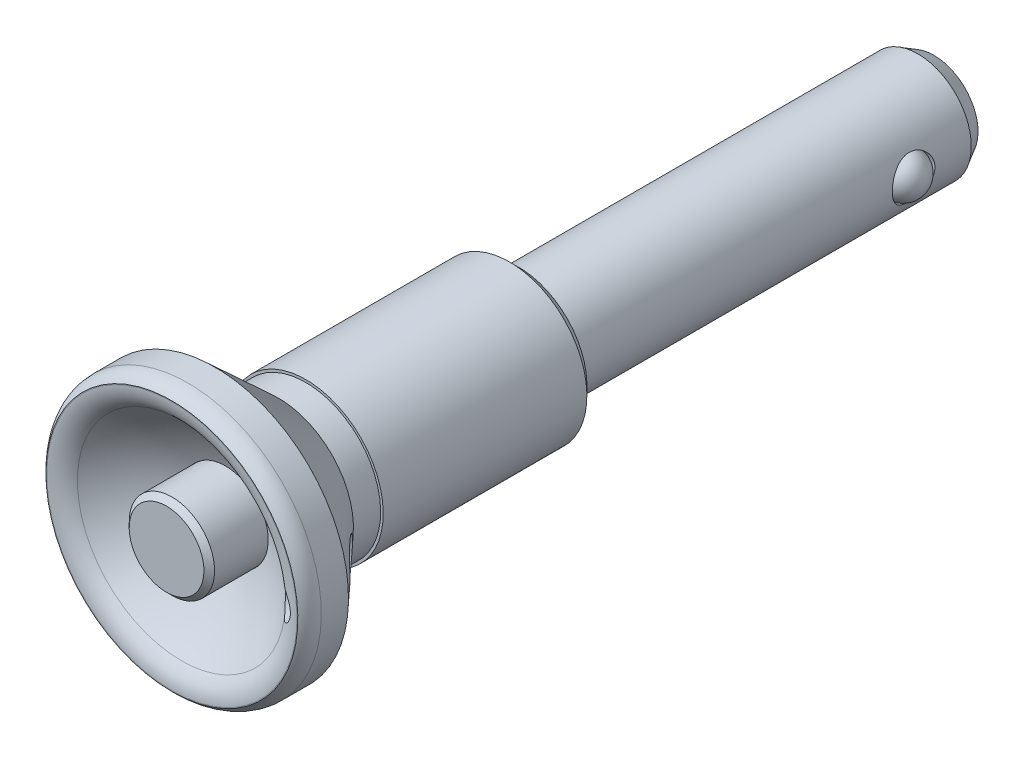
ISO-10303-21;
HEADER;
FILE_DESCRIPTION(('STEP AP214'),'2;1');
FILE_NAME('part.step','',(''),(''),'','','');
FILE_SCHEMA(('AUTOMOTIVE_DESIGN { 1 0 10303 214 1 1 1 1 }'));
ENDSEC;
DATA;
#1=APPLICATION_CONTEXT('core data for automotive mechanical design processes');
#2=APPLICATION_PROTOCOL_DEFINITION('international standard','automotive_design',2000,#1);
#3=PRODUCT_CONTEXT('',#1,'mechanical');
#4=PRODUCT('Part','Part','',(#3));
#5=PRODUCT_RELATED_PRODUCT_CATEGORY('part','',(#4));
#6=PRODUCT_DEFINITION_FORMATION('','',#4);
#7=PRODUCT_DEFINITION_CONTEXT('part definition',#1,'design');
#8=PRODUCT_DEFINITION('design','',#6,#7);
#9=PRODUCT_DEFINITION_SHAPE('','',#8);
#10=(LENGTH_UNIT() NAMED_UNIT(*) SI_UNIT(.MILLI.,.METRE.));
#11=(NAMED_UNIT(*) PLANE_ANGLE_UNIT() SI_UNIT($,.RADIAN.));
#12=(NAMED_UNIT(*) SI_UNIT($,.STERADIAN.) SOLID_ANGLE_UNIT());
#13=UNCERTAINTY_MEASURE_WITH_UNIT(LENGTH_MEASURE(1.E-05),#10,'distance_accuracy_value','');
#14=(GEOMETRIC_REPRESENTATION_CONTEXT(3) GLOBAL_UNCERTAINTY_ASSIGNED_CONTEXT((#13)) GLOBAL_UNIT_ASSIGNED_CONTEXT((#10,
#11,#12)) REPRESENTATION_CONTEXT('',''));
#15=CARTESIAN_POINT('',(0.,0.,0.));
#16=DIRECTION('',(0.,0.,1.));
#17=DIRECTION('',(1.,0.,0.));
#18=AXIS2_PLACEMENT_3D('',#15,#16,#17);
#19=CARTESIAN_POINT('',(0.,0.,-38.9));
#20=DIRECTION('',(0.,0.,-1.));
#21=DIRECTION('',(0.,1.,0.));
#22=AXIS2_PLACEMENT_3D('',#19,#20,#21);
#23=CYLINDRICAL_SURFACE('',#22,2.);
#24=CARTESIAN_POINT('',(0.,0.,-34.9));
#25=DIRECTION('',(0.,0.,-1.));
#26=DIRECTION('',(0.,1.,0.));
#27=AXIS2_PLACEMENT_3D('',#24,#25,#26);
#28=CIRCLE('',#27,2.);
#29=CARTESIAN_POINT('',(0.,2.,-34.9));
#30=VERTEX_POINT('',#29);
#31=EDGE_CURVE('E9',#30,#30,#28,.T.);
#32=ORIENTED_EDGE('',*,*,#31,.F.);
#33=EDGE_LOOP('',(#32));
#34=FACE_BOUND('',#33,.T.);
#35=CARTESIAN_POINT('',(0.,0.,-38.9));
#36=DIRECTION('',(0.,0.,-1.));
#37=DIRECTION('',(0.,1.,0.));
#38=AXIS2_PLACEMENT_3D('',#35,#36,#37);
#39=CIRCLE('',#38,2.);
#40=CARTESIAN_POINT('',(0.,2.,-38.9));
#41=VERTEX_POINT('',#40);
#42=EDGE_CURVE('E420',#41,#41,#39,.T.);
#43=ORIENTED_EDGE('',*,*,#42,.T.);
#44=EDGE_LOOP('',(#43));
#45=FACE_BOUND('',#44,.T.);
#46=ADVANCED_FACE('F14',(#34,#45),#23,.F.);
#47=CARTESIAN_POINT('',(0.,0.,-38.9));
#48=DIRECTION('',(0.,0.,-1.));
#49=DIRECTION('',(0.,1.,0.));
#50=AXIS2_PLACEMENT_3D('',#47,#48,#49);
#51=CYLINDRICAL_SURFACE('',#50,5.);
#52=CARTESIAN_POINT('',(4.58257569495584,2.,-32.));
#53=CARTESIAN_POINT('',(4.58258022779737,1.99999540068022,-32.107123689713));
#54=CARTESIAN_POINT('',(4.58638433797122,1.99134173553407,-32.2144262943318));
#55=CARTESIAN_POINT('',(4.601110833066,1.95706710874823,-32.4259390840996));
#56=CARTESIAN_POINT('',(4.61205140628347,1.93140279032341,-32.5301406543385));
#57=CARTESIAN_POINT('',(4.63960410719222,1.86423554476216,-32.7320518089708));
#58=CARTESIAN_POINT('',(4.65619484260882,1.82279228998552,-32.8297842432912));
#59=CARTESIAN_POINT('',(4.69314677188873,1.72542013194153,-33.0168853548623));
#60=CARTESIAN_POINT('',(4.71350714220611,1.66949439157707,-33.1062558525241));
#61=CARTESIAN_POINT('',(4.75700861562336,1.54132201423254,-33.2792603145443));
#62=CARTESIAN_POINT('',(4.78023917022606,1.46837936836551,-33.3623563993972));
#63=CARTESIAN_POINT('',(4.82612457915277,1.30970909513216,-33.5155290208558));
#64=CARTESIAN_POINT('',(4.84877922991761,1.22397701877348,-33.5856010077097));
#65=CARTESIAN_POINT('',(4.89203407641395,1.03800631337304,-33.7134063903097));
#66=CARTESIAN_POINT('',(4.9125180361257,0.937328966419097,-33.7705442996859));
#67=CARTESIAN_POINT('',(4.94803927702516,0.726825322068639,-33.8668435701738));
#68=CARTESIAN_POINT('',(4.96307877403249,0.617002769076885,-33.9060122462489));
#69=CARTESIAN_POINT('',(4.98538324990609,0.396966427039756,-33.9633414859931));
#70=CARTESIAN_POINT('',(4.99298936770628,0.287028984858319,-33.9824273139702));
#71=CARTESIAN_POINT('',(5.0008031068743,0.0652663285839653,-34.0020284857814));
#72=CARTESIAN_POINT('',(5.00101348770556,-0.0465581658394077,-34.0025507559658));
#73=CARTESIAN_POINT('',(4.99421962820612,-0.262232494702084,-33.9855172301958));
#74=CARTESIAN_POINT('',(4.98761996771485,-0.366177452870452,-33.9689752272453));
#75=CARTESIAN_POINT('',(4.96849291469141,-0.569673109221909,-33.920007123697));
#76=CARTESIAN_POINT('',(4.95596508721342,-0.669223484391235,-33.8875798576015));
#77=CARTESIAN_POINT('',(4.92596824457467,-0.862897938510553,-33.8073635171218));
#78=CARTESIAN_POINT('',(4.90842760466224,-0.956917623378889,-33.7593502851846));
#79=CARTESIAN_POINT('',(4.87014585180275,-1.1358081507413,-33.6495349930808));
#80=CARTESIAN_POINT('',(4.84940364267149,-1.22067584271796,-33.5877282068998));
#81=CARTESIAN_POINT('',(4.80521637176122,-1.38476882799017,-33.4473508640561));
#82=CARTESIAN_POINT('',(4.78168326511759,-1.46325784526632,-33.3679461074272));
#83=CARTESIAN_POINT('',(4.73561660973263,-1.60610741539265,-33.197009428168));
#84=CARTESIAN_POINT('',(4.71308339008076,-1.67046334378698,-33.1054735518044));
#85=CARTESIAN_POINT('',(4.67096897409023,-1.78490418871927,-32.9095809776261));
#86=CARTESIAN_POINT('',(4.65148914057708,-1.83453465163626,-32.8049351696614));
#87=CARTESIAN_POINT('',(4.61887590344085,-1.91517625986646,-32.5877845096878));
#88=CARTESIAN_POINT('',(4.60573837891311,-1.94619949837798,-32.4752848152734));
#89=CARTESIAN_POINT('',(4.58829759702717,-1.9869549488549,-32.2529642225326));
#90=CARTESIAN_POINT('',(4.58350366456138,-1.99787209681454,-32.1433995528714));
#91=CARTESIAN_POINT('',(4.58189497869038,-2.00156132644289,-31.9239227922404));
#92=CARTESIAN_POINT('',(4.58507780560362,-1.99433891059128,-31.8140108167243));
#93=CARTESIAN_POINT('',(4.59856044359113,-1.96303289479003,-31.6035410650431));
#94=CARTESIAN_POINT('',(4.60844457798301,-1.93993306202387,-31.5028070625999));
#95=CARTESIAN_POINT('',(4.6337005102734,-1.87880418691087,-31.3067115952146));
#96=CARTESIAN_POINT('',(4.64907352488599,-1.84077183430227,-31.2113513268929));
#97=CARTESIAN_POINT('',(4.68433781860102,-1.74913563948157,-31.0243976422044));
#98=CARTESIAN_POINT('',(4.70438704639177,-1.69496286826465,-30.9331138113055));
#99=CARTESIAN_POINT('',(4.74650385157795,-1.57316522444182,-30.7605170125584));
#100=CARTESIAN_POINT('',(4.76857224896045,-1.5055348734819,-30.6792081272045));
#101=CARTESIAN_POINT('',(4.81420915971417,-1.35284421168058,-30.5226265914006));
#102=CARTESIAN_POINT('',(4.83776807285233,-1.26686542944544,-30.4482434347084));
#103=CARTESIAN_POINT('',(4.88219794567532,-1.08308363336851,-30.3148229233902));
#104=CARTESIAN_POINT('',(4.90306879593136,-0.98528013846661,-30.2557861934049));
#105=CARTESIAN_POINT('',(4.9398371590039,-0.780279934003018,-30.1549523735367));
#106=CARTESIAN_POINT('',(4.9557358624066,-0.673085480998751,-30.1131511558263));
#107=CARTESIAN_POINT('',(4.98072713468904,-0.452393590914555,-30.0484511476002));
#108=CARTESIAN_POINT('',(4.98982339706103,-0.338899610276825,-30.0255420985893));
#109=CARTESIAN_POINT('',(4.99979008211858,-0.11681651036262,-30.0004952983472));
#110=CARTESIAN_POINT('',(5.00115846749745,-0.00839049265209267,-29.997099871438));
#111=CARTESIAN_POINT('',(4.99686042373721,0.20743383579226,-30.0078554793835));
#112=CARTESIAN_POINT('',(4.99119505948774,0.314832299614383,-30.0220038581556));
#113=CARTESIAN_POINT('',(4.97371513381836,0.522170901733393,-30.0665467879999));
#114=CARTESIAN_POINT('',(4.96209480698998,0.622238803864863,-30.0964289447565));
#115=CARTESIAN_POINT('',(4.93394947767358,0.815922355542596,-30.1710528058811));
#116=CARTESIAN_POINT('',(4.91742357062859,0.909536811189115,-30.2157972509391));
#117=CARTESIAN_POINT('',(4.88018094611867,1.09220303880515,-30.3211031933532));
#118=CARTESIAN_POINT('',(4.859311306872,1.18087037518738,-30.3822762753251));
#119=CARTESIAN_POINT('',(4.8158940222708,1.34705404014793,-30.517788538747));
#120=CARTESIAN_POINT('',(4.79334568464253,1.42456572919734,-30.5921331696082));
#121=CARTESIAN_POINT('',(4.74737767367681,1.57120121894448,-30.7573151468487));
#122=CARTESIAN_POINT('',(4.72399047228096,1.63950871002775,-30.8488885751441));
#123=CARTESIAN_POINT('',(4.68049656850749,1.75984762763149,-31.0429424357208));
#124=CARTESIAN_POINT('',(4.66039025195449,1.81187714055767,-31.1454241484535));
#125=CARTESIAN_POINT('',(4.62758914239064,1.89399048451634,-31.3490361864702));
#126=CARTESIAN_POINT('',(4.61439096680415,1.92562535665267,-31.4494616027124));
#127=CARTESIAN_POINT('',(4.5944582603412,1.97271990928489,-31.6544890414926));
#128=CARTESIAN_POINT('',(4.58770572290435,1.98822466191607,-31.7590785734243));
#129=CARTESIAN_POINT('',(4.5839176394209,1.99692202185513,-31.8867782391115));
#130=CARTESIAN_POINT('',(4.58341531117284,1.99807530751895,-31.9094014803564));
#131=CARTESIAN_POINT('',(4.58274384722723,1.9996148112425,-31.9546804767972));
#132=CARTESIAN_POINT('',(4.5825747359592,2.0000009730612,-31.9773362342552));
#133=CARTESIAN_POINT('',(4.58257569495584,2.,-32.));
#134=B_SPLINE_CURVE_WITH_KNOTS('',3,(#52,#53,#54,#55,#56,#57,#58,#59,#60,#61,#62,#63,#64,#65,
#66,#67,#68,#69,#70,#71,#72,#73,#74,#75,#76,#77,#78,#79,#80,#81,#82,#83,#84,#85,#86,#87,#88,#89,
#90,#91,#92,#93,#94,#95,#96,#97,#98,#99,#100,#101,#102,#103,#104,#105,#106,#107,#108,#109,#110,
#111,#112,#113,#114,#115,#116,#117,#118,#119,#120,#121,#122,#123,#124,#125,#126,#127,#128,#129,
#130,#131,#132,#133),.UNSPECIFIED.,.T.,.F.,(4,2,2,2,2,2,2,2,2,2,2,2,2,2,2,2,2,2,2,2,2,2,2,2,2,2,
2,2,2,2,2,2,2,2,2,2,2,2,2,2,4),(0.,0.321277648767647,0.643377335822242,0.964270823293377,
1.28509428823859,1.62255618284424,1.96013574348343,2.31102669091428,2.6617746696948,
2.99554182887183,3.32918445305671,3.64408644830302,3.95901155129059,4.27868300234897,
4.5984641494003,4.93924044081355,5.28012807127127,5.63064458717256,5.980933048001,
6.3098214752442,6.63861014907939,6.94867248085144,7.25880358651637,7.581511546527,
7.9043511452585,8.25103734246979,8.59773764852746,8.94435487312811,9.29078375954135,
9.61461039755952,9.938388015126,10.2522199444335,10.5661097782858,10.8938705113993,
11.2217671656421,11.5699625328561,11.9181988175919,12.2351666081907,12.5512463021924,
12.619212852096,12.6871843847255),.UNSPECIFIED.);
#135=CARTESIAN_POINT('',(4.58257569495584,2.,-32.));
#136=VERTEX_POINT('',#135);
#137=EDGE_CURVE('E401',#136,#136,#134,.T.);
#138=ORIENTED_EDGE('',*,*,#137,.T.);
#139=EDGE_LOOP('',(#138));
#140=FACE_BOUND('',#139,.T.);
#141=CARTESIAN_POINT('',(0.,0.,-37.4));
#142=DIRECTION('',(0.,0.,-1.));
#143=DIRECTION('',(0.,1.,0.));
#144=AXIS2_PLACEMENT_3D('',#141,#142,#143);
#145=CIRCLE('',#144,5.);
#146=CARTESIAN_POINT('',(0.,5.,-37.4));
#147=VERTEX_POINT('',#146);
#148=EDGE_CURVE('E67',#147,#147,#145,.T.);
#149=ORIENTED_EDGE('',*,*,#148,.F.);
#150=EDGE_LOOP('',(#149));
#151=FACE_BOUND('',#150,.T.);
#152=CARTESIAN_POINT('',(-4.58257569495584,2.,-32.));
#153=CARTESIAN_POINT('',(-4.58258022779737,1.99999540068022,-31.892876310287));
#154=CARTESIAN_POINT('',(-4.58638433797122,1.99134173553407,-31.7855737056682));
#155=CARTESIAN_POINT('',(-4.601110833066,1.95706710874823,-31.5740609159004));
#156=CARTESIAN_POINT('',(-4.61205140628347,1.93140279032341,-31.4698593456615));
#157=CARTESIAN_POINT('',(-4.63960410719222,1.86423554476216,-31.2679481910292));
#158=CARTESIAN_POINT('',(-4.65619484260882,1.82279228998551,-31.1702157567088));
#159=CARTESIAN_POINT('',(-4.69314677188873,1.72542013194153,-30.9831146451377));
#160=CARTESIAN_POINT('',(-4.71350714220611,1.66949439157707,-30.8937441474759));
#161=CARTESIAN_POINT('',(-4.75700861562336,1.54132201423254,-30.7207396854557));
#162=CARTESIAN_POINT('',(-4.78023917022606,1.46837936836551,-30.6376436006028));
#163=CARTESIAN_POINT('',(-4.82612457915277,1.30970909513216,-30.4844709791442));
#164=CARTESIAN_POINT('',(-4.84877922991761,1.22397701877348,-30.4143989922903));
#165=CARTESIAN_POINT('',(-4.89203407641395,1.03800631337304,-30.2865936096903));
#166=CARTESIAN_POINT('',(-4.9125180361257,0.937328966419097,-30.2294557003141));
#167=CARTESIAN_POINT('',(-4.94803927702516,0.726825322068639,-30.1331564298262));
#168=CARTESIAN_POINT('',(-4.96307877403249,0.617002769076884,-30.0939877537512));
#169=CARTESIAN_POINT('',(-4.98538324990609,0.396966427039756,-30.0366585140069));
#170=CARTESIAN_POINT('',(-4.99298936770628,0.28702898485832,-30.0175726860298));
#171=CARTESIAN_POINT('',(-5.0008031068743,0.0652663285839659,-29.9979715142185));
#172=CARTESIAN_POINT('',(-5.00101348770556,-0.0465581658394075,-29.9974492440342));
#173=CARTESIAN_POINT('',(-4.99421962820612,-0.262232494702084,-30.0144827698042));
#174=CARTESIAN_POINT('',(-4.98761996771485,-0.366177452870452,-30.0310247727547));
#175=CARTESIAN_POINT('',(-4.96849291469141,-0.569673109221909,-30.079992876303));
#176=CARTESIAN_POINT('',(-4.95596508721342,-0.669223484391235,-30.1124201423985));
#177=CARTESIAN_POINT('',(-4.92596824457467,-0.862897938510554,-30.1926364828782));
#178=CARTESIAN_POINT('',(-4.90842760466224,-0.95691762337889,-30.2406497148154));
#179=CARTESIAN_POINT('',(-4.87014585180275,-1.13580815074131,-30.3504650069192));
#180=CARTESIAN_POINT('',(-4.84940364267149,-1.22067584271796,-30.4122717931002));
#181=CARTESIAN_POINT('',(-4.80521637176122,-1.38476882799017,-30.5526491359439));
#182=CARTESIAN_POINT('',(-4.78168326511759,-1.46325784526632,-30.6320538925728));
#183=CARTESIAN_POINT('',(-4.73561660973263,-1.60610741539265,-30.802990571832));
#184=CARTESIAN_POINT('',(-4.71308339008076,-1.67046334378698,-30.8945264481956));
#185=CARTESIAN_POINT('',(-4.67096897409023,-1.78490418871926,-31.0904190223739));
#186=CARTESIAN_POINT('',(-4.65148914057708,-1.83453465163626,-31.1950648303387));
#187=CARTESIAN_POINT('',(-4.61887590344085,-1.91517625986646,-31.4122154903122));
#188=CARTESIAN_POINT('',(-4.60573837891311,-1.94619949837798,-31.5247151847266));
#189=CARTESIAN_POINT('',(-4.58829759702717,-1.9869549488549,-31.7470357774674));
#190=CARTESIAN_POINT('',(-4.58350366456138,-1.99787209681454,-31.8566004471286));
#191=CARTESIAN_POINT('',(-4.58189497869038,-2.00156132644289,-32.0760772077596));
#192=CARTESIAN_POINT('',(-4.58507780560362,-1.99433891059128,-32.1859891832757));
#193=CARTESIAN_POINT('',(-4.59856044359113,-1.96303289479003,-32.3964589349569));
#194=CARTESIAN_POINT('',(-4.60844457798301,-1.93993306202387,-32.4971929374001));
#195=CARTESIAN_POINT('',(-4.6337005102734,-1.87880418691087,-32.6932884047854));
#196=CARTESIAN_POINT('',(-4.64907352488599,-1.84077183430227,-32.7886486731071));
#197=CARTESIAN_POINT('',(-4.68433781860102,-1.74913563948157,-32.9756023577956));
#198=CARTESIAN_POINT('',(-4.70438704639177,-1.69496286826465,-33.0668861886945));
#199=CARTESIAN_POINT('',(-4.74650385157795,-1.57316522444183,-33.2394829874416));
#200=CARTESIAN_POINT('',(-4.76857224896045,-1.5055348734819,-33.3207918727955));
#201=CARTESIAN_POINT('',(-4.81420915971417,-1.35284421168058,-33.4773734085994));
#202=CARTESIAN_POINT('',(-4.83776807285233,-1.26686542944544,-33.5517565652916));
#203=CARTESIAN_POINT('',(-4.88219794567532,-1.08308363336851,-33.6851770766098));
#204=CARTESIAN_POINT('',(-4.90306879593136,-0.98528013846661,-33.7442138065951));
#205=CARTESIAN_POINT('',(-4.9398371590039,-0.780279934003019,-33.8450476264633));
#206=CARTESIAN_POINT('',(-4.9557358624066,-0.673085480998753,-33.8868488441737));
#207=CARTESIAN_POINT('',(-4.98072713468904,-0.452393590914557,-33.9515488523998));
#208=CARTESIAN_POINT('',(-4.98982339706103,-0.338899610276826,-33.9744579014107));
#209=CARTESIAN_POINT('',(-4.99979008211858,-0.11681651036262,-33.9995047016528));
#210=CARTESIAN_POINT('',(-5.00115846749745,-0.00839049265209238,-34.002900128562));
#211=CARTESIAN_POINT('',(-4.99686042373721,0.20743383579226,-33.9921445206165));
#212=CARTESIAN_POINT('',(-4.99119505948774,0.314832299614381,-33.9779961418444));
#213=CARTESIAN_POINT('',(-4.97371513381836,0.522170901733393,-33.9334532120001));
#214=CARTESIAN_POINT('',(-4.96209480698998,0.622238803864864,-33.9035710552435));
#215=CARTESIAN_POINT('',(-4.93394947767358,0.815922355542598,-33.8289471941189));
#216=CARTESIAN_POINT('',(-4.91742357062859,0.909536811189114,-33.7842027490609));
#217=CARTESIAN_POINT('',(-4.88018094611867,1.09220303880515,-33.6788968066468));
#218=CARTESIAN_POINT('',(-4.859311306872,1.18087037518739,-33.6177237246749));
#219=CARTESIAN_POINT('',(-4.8158940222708,1.34705404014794,-33.482211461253));
#220=CARTESIAN_POINT('',(-4.79334568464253,1.42456572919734,-33.4078668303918));
#221=CARTESIAN_POINT('',(-4.74737767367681,1.57120121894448,-33.2426848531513));
#222=CARTESIAN_POINT('',(-4.72399047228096,1.63950871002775,-33.1511114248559));
#223=CARTESIAN_POINT('',(-4.6804965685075,1.75984762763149,-32.9570575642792));
#224=CARTESIAN_POINT('',(-4.66039025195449,1.81187714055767,-32.8545758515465));
#225=CARTESIAN_POINT('',(-4.62758914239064,1.89399048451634,-32.6509638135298));
#226=CARTESIAN_POINT('',(-4.61439096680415,1.92562535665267,-32.5505383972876));
#227=CARTESIAN_POINT('',(-4.5944582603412,1.97271990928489,-32.3455109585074));
#228=CARTESIAN_POINT('',(-4.58770572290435,1.98822466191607,-32.2409214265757));
#229=CARTESIAN_POINT('',(-4.5839176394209,1.99692202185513,-32.1132217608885));
#230=CARTESIAN_POINT('',(-4.58341531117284,1.99807530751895,-32.0905985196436));
#231=CARTESIAN_POINT('',(-4.58274384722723,1.9996148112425,-32.0453195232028));
#232=CARTESIAN_POINT('',(-4.5825747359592,2.0000009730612,-32.0226637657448));
#233=CARTESIAN_POINT('',(-4.58257569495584,2.,-32.));
#234=B_SPLINE_CURVE_WITH_KNOTS('',3,(#152,#153,#154,#155,#156,#157,#158,#159,#160,#161,#162,
#163,#164,#165,#166,#167,#168,#169,#170,#171,#172,#173,#174,#175,#176,#177,#178,#179,#180,#181,
#182,#183,#184,#185,#186,#187,#188,#189,#190,#191,#192,#193,#194,#195,#196,#197,#198,#199,#200,
#201,#202,#203,#204,#205,#206,#207,#208,#209,#210,#211,#212,#213,#214,#215,#216,#217,#218,#219,
#220,#221,#222,#223,#224,#225,#226,#227,#228,#229,#230,#231,#232,#233),.UNSPECIFIED.,.T.,.F.,(4,
2,2,2,2,2,2,2,2,2,2,2,2,2,2,2,2,2,2,2,2,2,2,2,2,2,2,2,2,2,2,2,2,2,2,2,2,2,2,2,4),(0.,
0.321277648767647,0.643377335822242,0.964270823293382,1.2850942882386,1.62255618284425,
1.96013574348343,2.31102669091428,2.6617746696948,2.99554182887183,3.32918445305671,
3.64408644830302,3.95901155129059,4.27868300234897,4.5984641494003,4.93924044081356,
5.28012807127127,5.63064458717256,5.980933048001,6.3098214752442,6.63861014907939,
6.94867248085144,7.25880358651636,7.581511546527,7.9043511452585,8.25103734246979,
8.59773764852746,8.94435487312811,9.29078375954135,9.61461039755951,9.938388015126,
10.2522199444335,10.5661097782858,10.8938705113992,11.2217671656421,11.5699625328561,
11.9181988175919,12.2351666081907,12.5512463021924,12.619212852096,12.6871843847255),.UNSPECIFIED.);
#235=CARTESIAN_POINT('',(-4.58257569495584,2.,-32.));
#236=VERTEX_POINT('',#235);
#237=EDGE_CURVE('E61',#236,#236,#234,.T.);
#238=ORIENTED_EDGE('',*,*,#237,.T.);
#239=EDGE_LOOP('',(#238));
#240=FACE_BOUND('',#239,.T.);
#241=CARTESIAN_POINT('',(0.,0.,0.));
#242=DIRECTION('',(0.,0.,1.));
#243=DIRECTION('',(1.,0.,0.));
#244=AXIS2_PLACEMENT_3D('',#241,#242,#243);
#245=CIRCLE('',#244,5.);
#246=CARTESIAN_POINT('',(5.,0.,0.));
#247=VERTEX_POINT('',#246);
#248=EDGE_CURVE('E73',#247,#247,#245,.T.);
#249=ORIENTED_EDGE('',*,*,#248,.F.);
#250=EDGE_LOOP('',(#249));
#251=FACE_BOUND('',#250,.T.);
#252=ADVANCED_FACE('F395',(#140,#151,#240,#251),#51,.T.);
#253=CARTESIAN_POINT('',(2.,0.,-38.9));
#254=DIRECTION('',(0.,0.,-1.));
#255=DIRECTION('',(0.,1.,0.));
#256=AXIS2_PLACEMENT_3D('',#253,#254,#255);
#257=PLANE('',#256);
#258=CARTESIAN_POINT('',(0.,0.,-38.9));
#259=DIRECTION('',(0.,0.,-1.));
#260=DIRECTION('',(0.,1.,0.));
#261=AXIS2_PLACEMENT_3D('',#258,#259,#260);
#262=CIRCLE('',#261,4.13397459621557);
#263=CARTESIAN_POINT('',(0.,4.13397459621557,-38.9));
#264=VERTEX_POINT('',#263);
#265=EDGE_CURVE('E424',#264,#264,#262,.T.);
#266=ORIENTED_EDGE('',*,*,#265,.T.);
#267=EDGE_LOOP('',(#266));
#268=FACE_BOUND('',#267,.T.);
#269=ORIENTED_EDGE('',*,*,#42,.F.);
#270=EDGE_LOOP('',(#269));
#271=FACE_BOUND('',#270,.T.);
#272=ADVANCED_FACE('F437',(#268,#271),#257,.T.);
#273=CARTESIAN_POINT('',(0.,0.,-38.9));
#274=DIRECTION('',(0.,0.,1.));
#275=DIRECTION('',(0.,-1.,0.));
#276=AXIS2_PLACEMENT_3D('',#273,#274,#275);
#277=CONICAL_SURFACE('',#276,4.13397459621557,0.523598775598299);
#278=ORIENTED_EDGE('',*,*,#148,.T.);
#279=EDGE_LOOP('',(#278));
#280=FACE_BOUND('',#279,.T.);
#281=ORIENTED_EDGE('',*,*,#265,.F.);
#282=EDGE_LOOP('',(#281));
#283=FACE_BOUND('',#282,.T.);
#284=ADVANCED_FACE('F433',(#280,#283),#277,.T.);
#285=CARTESIAN_POINT('',(6.,0.,-32.));
#286=DIRECTION('',(1.,0.,0.));
#287=DIRECTION('',(0.,1.,0.));
#288=AXIS2_PLACEMENT_3D('',#285,#286,#287);
#289=CYLINDRICAL_SURFACE('',#288,2.);
#290=CARTESIAN_POINT('',(3.69295257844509,2.,-32.));
#291=CARTESIAN_POINT('',(3.69296124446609,1.99999252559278,-31.8950365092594));
#292=CARTESIAN_POINT('',(3.69749476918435,1.99168229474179,-31.7899198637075));
#293=CARTESIAN_POINT('',(3.71499510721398,1.95883523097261,-31.5828549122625));
#294=CARTESIAN_POINT('',(3.72798128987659,1.93426112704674,-31.4809144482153));
#295=CARTESIAN_POINT('',(3.76054820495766,1.87014699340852,-31.2835779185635));
#296=CARTESIAN_POINT('',(3.78009636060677,1.83068077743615,-31.1881522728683));
#297=CARTESIAN_POINT('',(3.82353505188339,1.73812635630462,-31.0052997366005));
#298=CARTESIAN_POINT('',(3.84742546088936,1.68503854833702,-30.9178726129));
#299=CARTESIAN_POINT('',(3.89903612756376,1.56210627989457,-30.7462961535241));
#300=CARTESIAN_POINT('',(3.92690909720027,1.49130855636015,-30.6628754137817));
#301=CARTESIAN_POINT('',(3.98210623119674,1.33695443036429,-30.5085333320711));
#302=CARTESIAN_POINT('',(4.00943013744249,1.25339217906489,-30.437617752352));
#303=CARTESIAN_POINT('',(4.0624063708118,1.06976932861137,-30.3061632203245));
#304=CARTESIAN_POINT('',(4.08786122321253,0.969021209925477,-30.2464976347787));
#305=CARTESIAN_POINT('',(4.1322840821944,0.757479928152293,-30.1452903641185));
#306=CARTESIAN_POINT('',(4.15125580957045,0.646692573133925,-30.1037382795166));
#307=CARTESIAN_POINT('',(4.17948005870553,0.425917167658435,-30.0427479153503));
#308=CARTESIAN_POINT('',(4.18928822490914,0.316352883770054,-30.0220384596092));
#309=CARTESIAN_POINT('',(4.20013773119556,0.0948978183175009,-29.9991585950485));
#310=CARTESIAN_POINT('',(4.20118382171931,-0.0169916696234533,-29.996978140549));
#311=CARTESIAN_POINT('',(4.1946744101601,-0.230460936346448,-30.0106738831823));
#312=CARTESIAN_POINT('',(4.18779244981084,-0.332156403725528,-30.0251360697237));
#313=CARTESIAN_POINT('',(4.1671904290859,-0.531473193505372,-30.0692085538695));
#314=CARTESIAN_POINT('',(4.15346986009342,-0.629094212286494,-30.0988199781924));
#315=CARTESIAN_POINT('',(4.12021451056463,-0.819264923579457,-30.1726068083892));
#316=CARTESIAN_POINT('',(4.10059733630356,-0.911719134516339,-30.2169896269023));
#317=CARTESIAN_POINT('',(4.05736238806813,-1.08810289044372,-30.3188060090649));
#318=CARTESIAN_POINT('',(4.03374315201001,-1.17202930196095,-30.376244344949));
#319=CARTESIAN_POINT('',(3.98232079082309,-1.33682830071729,-30.508356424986));
#320=CARTESIAN_POINT('',(3.95433239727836,-1.41678585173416,-30.5841006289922));
#321=CARTESIAN_POINT('',(3.89872441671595,-1.56333053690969,-30.7477715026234));
#322=CARTESIAN_POINT('',(3.87110507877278,-1.62990902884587,-30.8357059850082));
#323=CARTESIAN_POINT('',(3.81780436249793,-1.75125633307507,-31.0270633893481));
#324=CARTESIAN_POINT('',(3.79230552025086,-1.80520353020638,-31.1310630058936));
#325=CARTESIAN_POINT('',(3.74853610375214,-1.89443193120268,-31.3481814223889));
#326=CARTESIAN_POINT('',(3.73025862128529,-1.92973098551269,-31.4612913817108));
#327=CARTESIAN_POINT('',(3.70489726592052,-1.97796079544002,-31.6842923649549));
#328=CARTESIAN_POINT('',(3.69706613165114,-1.99239193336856,-31.7937711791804));
#329=CARTESIAN_POINT('',(3.69134421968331,-2.00297881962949,-32.013842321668));
#330=CARTESIAN_POINT('',(3.69344777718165,-1.99914498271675,-32.1244339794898));
#331=CARTESIAN_POINT('',(3.70656984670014,-1.97468704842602,-32.3324720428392));
#332=CARTESIAN_POINT('',(3.71672580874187,-1.95568631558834,-32.4301719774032));
#333=CARTESIAN_POINT('',(3.74358473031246,-1.90376463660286,-32.6208457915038));
#334=CARTESIAN_POINT('',(3.76028958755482,-1.87083965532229,-32.7138182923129));
#335=CARTESIAN_POINT('',(3.79928393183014,-1.79036865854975,-32.8972604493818));
#336=CARTESIAN_POINT('',(3.82179608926,-1.74221652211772,-32.9874151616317));
#337=CARTESIAN_POINT('',(3.86963561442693,-1.63320542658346,-33.1588668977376));
#338=CARTESIAN_POINT('',(3.89496439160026,-1.5723400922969,-33.2401594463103));
#339=CARTESIAN_POINT('',(3.94900124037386,-1.43163394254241,-33.401103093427));
#340=CARTESIAN_POINT('',(3.97776977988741,-1.35043069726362,-33.4795481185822));
#341=CARTESIAN_POINT('',(4.03293385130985,-1.17547949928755,-33.6220285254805));
#342=CARTESIAN_POINT('',(4.05932880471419,-1.08172850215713,-33.6860604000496));
#343=CARTESIAN_POINT('',(4.10741012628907,-0.881934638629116,-33.7987682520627));
#344=CARTESIAN_POINT('',(4.12900486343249,-0.775703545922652,-33.8471523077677));
#345=CARTESIAN_POINT('',(4.16436909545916,-0.555289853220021,-33.9249103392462));
#346=CARTESIAN_POINT('',(4.17814481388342,-0.441113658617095,-33.9542994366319));
#347=CARTESIAN_POINT('',(4.19540926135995,-0.21864780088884,-33.9909275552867));
#348=CARTESIAN_POINT('',(4.19968035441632,-0.110695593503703,-33.9998531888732));
#349=CARTESIAN_POINT('',(4.1998175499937,0.105223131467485,-34.0001430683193));
#350=CARTESIAN_POINT('',(4.19568607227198,0.213189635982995,-33.9915123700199));
#351=CARTESIAN_POINT('',(4.17993566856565,0.41973111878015,-33.9581010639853));
#352=CARTESIAN_POINT('',(4.168749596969,0.518493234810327,-33.9342532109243));
#353=CARTESIAN_POINT('',(4.1403533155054,0.710491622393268,-33.872267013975));
#354=CARTESIAN_POINT('',(4.12314216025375,0.80372702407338,-33.8341264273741));
#355=CARTESIAN_POINT('',(4.08331986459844,0.986690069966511,-33.7428034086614));
#356=CARTESIAN_POINT('',(4.06050114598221,1.07607281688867,-33.6890230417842));
#357=CARTESIAN_POINT('',(4.01195381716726,1.24493254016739,-33.5687268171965));
#358=CARTESIAN_POINT('',(3.98622388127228,1.32440496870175,-33.5022051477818));
#359=CARTESIAN_POINT('',(3.9317186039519,1.47877758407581,-33.3512584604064));
#360=CARTESIAN_POINT('',(3.90287905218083,1.55260530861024,-33.2657556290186));
#361=CARTESIAN_POINT('',(3.8474945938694,1.68518766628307,-33.0830092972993));
#362=CARTESIAN_POINT('',(3.82095142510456,1.74393094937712,-32.9857570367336));
#363=CARTESIAN_POINT('',(3.77299479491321,1.84543916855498,-32.7795828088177));
#364=CARTESIAN_POINT('',(3.75168341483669,1.88789405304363,-32.6704807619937));
#365=CARTESIAN_POINT('',(3.72647961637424,1.93689798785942,-32.5018569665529));
#366=CARTESIAN_POINT('',(3.71920915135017,1.95078018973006,-32.4448752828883));
#367=CARTESIAN_POINT('',(3.70719734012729,1.97351358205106,-32.3296687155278));
#368=CARTESIAN_POINT('',(3.7024541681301,1.98236840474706,-32.2714447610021));
#369=CARTESIAN_POINT('',(3.69705078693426,1.99241849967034,-32.1775698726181));
#370=CARTESIAN_POINT('',(3.69551719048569,1.99525904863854,-32.1421353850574));
#371=CARTESIAN_POINT('',(3.69346659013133,1.99905111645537,-32.0711398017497));
#372=CARTESIAN_POINT('',(3.69294964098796,2.00000253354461,-32.035578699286));
#373=CARTESIAN_POINT('',(3.69295257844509,2.,-32.));
#374=B_SPLINE_CURVE_WITH_KNOTS('',3,(#290,#291,#292,#293,#294,#295,#296,#297,#298,#299,#300,
#301,#302,#303,#304,#305,#306,#307,#308,#309,#310,#311,#312,#313,#314,#315,#316,#317,#318,#319,
#320,#321,#322,#323,#324,#325,#326,#327,#328,#329,#330,#331,#332,#333,#334,#335,#336,#337,#338,
#339,#340,#341,#342,#343,#344,#345,#346,#347,#348,#349,#350,#351,#352,#353,#354,#355,#356,#357,
#358,#359,#360,#361,#362,#363,#364,#365,#366,#367,#368,#369,#370,#371,#372,#373),.UNSPECIFIED.,
.T.,.F.,(4,2,2,2,2,2,2,2,2,2,2,2,2,2,2,2,2,2,2,2,2,2,2,2,2,2,2,2,2,2,2,2,2,2,2,2,2,2,2,2,2,4),
(0.,0.314747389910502,0.630218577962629,0.94414622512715,1.25806471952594,1.59535393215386,
1.93279816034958,2.2904080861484,2.64781242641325,2.98178553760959,3.31557757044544,
3.62297848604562,3.9304022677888,4.24233891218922,4.55438976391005,4.89383754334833,
5.2335038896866,5.59132862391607,5.94881021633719,6.27903319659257,6.60906790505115,
6.90786821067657,7.20675516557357,7.51947407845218,7.83235018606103,8.18030775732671,
8.52834990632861,8.88255362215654,9.2364750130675,9.55997846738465,9.88338877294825,
10.1886636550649,10.4939864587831,10.8130037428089,11.1321668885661,11.4803449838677,
11.8287842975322,12.1835611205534,12.3606240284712,12.5375588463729,12.6442406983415,
12.750928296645),.UNSPECIFIED.);
#375=CARTESIAN_POINT('',(3.85225966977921,1.67272059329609,-33.0963602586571));
#376=VERTEX_POINT('',#375);
#377=CARTESIAN_POINT('',(3.85225966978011,-1.67272059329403,-33.0963602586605));
#378=VERTEX_POINT('',#377);
#379=EDGE_CURVE('E63',#376,#378,#374,.T.);
#380=ORIENTED_EDGE('',*,*,#379,.F.);
#381=CARTESIAN_POINT('',(4.19974984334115,0.,-33.99999999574));
#382=CARTESIAN_POINT('',(4.19974979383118,0.112133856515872,-33.9999951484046));
#383=CARTESIAN_POINT('',(4.19927754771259,0.224413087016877,-33.9905315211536));
#384=CARTESIAN_POINT('',(4.19737987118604,0.445943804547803,-33.9528961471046));
#385=CARTESIAN_POINT('',(4.19595246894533,0.555188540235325,-33.9246857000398));
#386=CARTESIAN_POINT('',(4.1921221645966,0.767313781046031,-33.8503623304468));
#387=CARTESIAN_POINT('',(4.1897200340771,0.870199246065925,-33.8042635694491));
#388=CARTESIAN_POINT('',(4.18389859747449,1.06670436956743,-33.6955084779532));
#389=CARTESIAN_POINT('',(4.18047981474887,1.16032876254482,-33.6328606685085));
#390=CARTESIAN_POINT('',(4.17254294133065,1.33575977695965,-33.492765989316));
#391=CARTESIAN_POINT('',(4.16802447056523,1.41756229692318,-33.4153140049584));
#392=CARTESIAN_POINT('',(4.15774347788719,1.56703120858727,-33.2478047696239));
#393=CARTESIAN_POINT('',(4.15198042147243,1.63469150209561,-33.1577421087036));
#394=CARTESIAN_POINT('',(4.13889872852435,1.75400147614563,-32.9675249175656));
#395=CARTESIAN_POINT('',(4.13157812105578,1.80563066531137,-32.8673576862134));
#396=CARTESIAN_POINT('',(4.11478827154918,1.89126247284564,-32.6600522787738));
#397=CARTESIAN_POINT('',(4.1053223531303,1.92529209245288,-32.552925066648));
#398=CARTESIAN_POINT('',(4.08797788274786,1.96230917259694,-32.3903489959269));
#399=CARTESIAN_POINT('',(4.08173176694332,1.97228597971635,-32.3362647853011));
#400=CARTESIAN_POINT('',(4.06714094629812,1.98774141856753,-32.2278123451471));
#401=CARTESIAN_POINT('',(4.05879592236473,1.99321936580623,-32.1734440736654));
#402=CARTESIAN_POINT('',(4.04230132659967,1.99805364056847,-32.0921402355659));
#403=CARTESIAN_POINT('',(4.03615353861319,1.99910232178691,-32.0651242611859));
#404=CARTESIAN_POINT('',(4.02444072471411,1.99970372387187,-32.0347632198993));
#405=CARTESIAN_POINT('',(4.02250757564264,1.99977855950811,-32.030121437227));
#406=CARTESIAN_POINT('',(4.01814107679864,1.99989236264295,-32.0211873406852));
#407=CARTESIAN_POINT('',(4.01572346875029,1.99993228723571,-32.0168888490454));
#408=CARTESIAN_POINT('',(4.01208715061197,1.99996240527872,-32.0122892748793));
#409=CARTESIAN_POINT('',(4.01145667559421,1.99996683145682,-32.011541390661));
#410=CARTESIAN_POINT('',(4.01012709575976,1.99997459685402,-32.0101050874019));
#411=CARTESIAN_POINT('',(4.0094278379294,1.99997793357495,-32.0094168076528));
#412=CARTESIAN_POINT('',(4.0079377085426,1.99998361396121,-32.0081222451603));
#413=CARTESIAN_POINT('',(4.0071456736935,1.99998594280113,-32.0075172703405));
#414=CARTESIAN_POINT('',(4.00546606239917,1.99998963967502,-32.0064591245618));
#415=CARTESIAN_POINT('',(4.00457899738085,1.99999101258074,-32.0060051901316));
#416=CARTESIAN_POINT('',(4.00309539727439,1.99999254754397,-32.0054637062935));
#417=CARTESIAN_POINT('',(4.00252608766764,1.99999297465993,-32.005302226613));
#418=CARTESIAN_POINT('',(4.00136845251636,1.99999355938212,-32.0050769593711));
#419=CARTESIAN_POINT('',(4.00078014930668,1.99999371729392,-32.0050130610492));
#420=CARTESIAN_POINT('',(3.99960008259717,1.99999377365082,-32.0049905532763));
#421=CARTESIAN_POINT('',(3.99900831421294,1.99999367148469,-32.0050321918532));
#422=CARTESIAN_POINT('',(3.99784054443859,1.99999320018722,-32.0052160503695));
#423=CARTESIAN_POINT('',(3.99726456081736,1.99999283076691,-32.0053583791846));
#424=CARTESIAN_POINT('',(3.99596613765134,1.99999164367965,-32.0057864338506));
#425=CARTESIAN_POINT('',(3.99525401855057,1.99999072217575,-32.0061030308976));
#426=CARTESIAN_POINT('',(3.99388863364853,1.99998832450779,-32.0068440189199));
#427=CARTESIAN_POINT('',(3.99323551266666,1.99998684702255,-32.0072686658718));
#428=CARTESIAN_POINT('',(3.99148747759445,1.9999818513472,-32.008559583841));
#429=CARTESIAN_POINT('',(3.99045448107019,1.99997764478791,-32.0095084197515));
#430=CARTESIAN_POINT('',(3.98852680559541,1.99996699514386,-32.011536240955));
#431=CARTESIAN_POINT('',(3.98763259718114,1.99996054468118,-32.0126156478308));
#432=CARTESIAN_POINT('',(3.98395592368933,1.99992720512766,-32.0174572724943));
#433=CARTESIAN_POINT('',(3.9816608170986,1.99988785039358,-32.0215770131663));
#434=CARTESIAN_POINT('',(3.9775382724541,1.99977908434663,-32.0300410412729));
#435=CARTESIAN_POINT('',(3.97571429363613,1.99970946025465,-32.0343867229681));
#436=CARTESIAN_POINT('',(3.96598133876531,1.99922202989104,-32.0594419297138));
#437=CARTESIAN_POINT('',(3.96058685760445,1.99847042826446,-32.0810801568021));
#438=CARTESIAN_POINT('',(3.95094475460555,1.9962386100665,-32.1245892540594));
#439=CARTESIAN_POINT('',(3.94670543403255,1.99475332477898,-32.1464606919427));
#440=CARTESIAN_POINT('',(3.93509414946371,1.98918869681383,-32.2122537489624));
#441=CARTESIAN_POINT('',(3.9288385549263,1.98400126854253,-32.2563147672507));
#442=CARTESIAN_POINT('',(3.9175034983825,1.97070199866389,-32.3439535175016));
#443=CARTESIAN_POINT('',(3.91242053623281,1.96259904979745,-32.3875323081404));
#444=CARTESIAN_POINT('',(3.89827773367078,1.93388686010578,-32.5176547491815));
#445=CARTESIAN_POINT('',(3.89034994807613,1.90888988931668,-32.6033988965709));
#446=CARTESIAN_POINT('',(3.87421219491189,1.83976683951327,-32.7923428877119));
#447=CARTESIAN_POINT('',(3.86644907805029,1.79238269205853,-32.8943953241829));
#448=CARTESIAN_POINT('',(3.85257985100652,1.68112524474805,-33.0892232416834));
#449=CARTESIAN_POINT('',(3.84647416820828,1.61724770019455,-33.1819963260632));
#450=CARTESIAN_POINT('',(3.83555894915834,1.4747938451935,-33.3555771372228));
#451=CARTESIAN_POINT('',(3.83074952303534,1.39621628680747,-33.4363838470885));
#452=CARTESIAN_POINT('',(3.82225891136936,1.22659246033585,-33.5836946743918));
#453=CARTESIAN_POINT('',(3.81857766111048,1.13554690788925,-33.6501996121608));
#454=CARTESIAN_POINT('',(3.8122496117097,0.943553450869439,-33.7670129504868));
#455=CARTESIAN_POINT('',(3.80960291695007,0.842604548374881,-33.8173197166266));
#456=CARTESIAN_POINT('',(3.80529420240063,0.633677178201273,-33.9002859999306));
#457=CARTESIAN_POINT('',(3.80363219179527,0.525698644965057,-33.9329453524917));
#458=CARTESIAN_POINT('',(3.80126727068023,0.30585183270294,-33.9796655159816));
#459=CARTESIAN_POINT('',(3.80056375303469,0.193986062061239,-33.9937381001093));
#460=CARTESIAN_POINT('',(3.8001038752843,-0.0305226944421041,-34.0029204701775));
#461=CARTESIAN_POINT('',(3.80034751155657,-0.143165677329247,-33.9980303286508));
#462=CARTESIAN_POINT('',(3.80178509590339,-0.365999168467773,-33.9694312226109));
#463=CARTESIAN_POINT('',(3.80297878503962,-0.476190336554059,-33.945727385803));
#464=CARTESIAN_POINT('',(3.80633396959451,-0.691023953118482,-33.8801856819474));
#465=CARTESIAN_POINT('',(3.8084954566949,-0.795666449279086,-33.8383479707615));
#466=CARTESIAN_POINT('',(3.81382337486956,-0.99644849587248,-33.7377286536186));
#467=CARTESIAN_POINT('',(3.81698992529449,-1.09258703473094,-33.6789450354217));
#468=CARTESIAN_POINT('',(3.82439824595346,-1.27362959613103,-33.5461160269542));
#469=CARTESIAN_POINT('',(3.82864008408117,-1.35853290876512,-33.4720696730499));
#470=CARTESIAN_POINT('',(3.83832255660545,-1.51475132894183,-33.3107773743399));
#471=CARTESIAN_POINT('',(3.84376398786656,-1.58605734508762,-33.2235226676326));
#472=CARTESIAN_POINT('',(3.85610678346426,-1.71297777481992,-33.0384161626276));
#473=CARTESIAN_POINT('',(3.8630077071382,-1.76859691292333,-32.9405675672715));
#474=CARTESIAN_POINT('',(3.87872632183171,-1.86264033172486,-32.7369651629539));
#475=CARTESIAN_POINT('',(3.88754441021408,-1.90106104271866,-32.6312097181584));
#476=CARTESIAN_POINT('',(3.90352637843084,-1.94500998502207,-32.469153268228));
#477=CARTESIAN_POINT('',(3.9093245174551,-1.95738820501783,-32.4144722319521));
#478=CARTESIAN_POINT('',(3.92228345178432,-1.97747981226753,-32.3044253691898));
#479=CARTESIAN_POINT('',(3.92944220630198,-1.98520011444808,-32.2490606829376));
#480=CARTESIAN_POINT('',(3.94292325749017,-1.99317462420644,-32.1672741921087));
#481=CARTESIAN_POINT('',(3.94775450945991,-1.99522444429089,-32.1407306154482));
#482=CARTESIAN_POINT('',(3.95873258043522,-1.99823673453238,-32.0878916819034));
#483=CARTESIAN_POINT('',(3.96486927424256,-1.99920723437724,-32.0615959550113));
#484=CARTESIAN_POINT('',(3.97736506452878,-1.99977986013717,-32.0303337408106));
#485=CARTESIAN_POINT('',(3.98011053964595,-1.99986240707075,-32.0241519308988));
#486=CARTESIAN_POINT('',(3.98496407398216,-1.9999354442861,-32.0162181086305));
#487=CARTESIAN_POINT('',(3.98641181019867,-1.99995127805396,-32.0140960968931));
#488=CARTESIAN_POINT('',(3.98888652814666,-1.99996921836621,-32.0111413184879));
#489=CARTESIAN_POINT('',(3.98976836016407,-1.99997424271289,-32.0101892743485));
#490=CARTESIAN_POINT('',(3.99166535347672,-1.9999824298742,-32.0084283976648));
#491=CARTESIAN_POINT('',(3.99267986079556,-1.99998560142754,-32.0076189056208));
#492=CARTESIAN_POINT('',(3.99432156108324,-1.99998914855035,-32.0065974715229));
#493=CARTESIAN_POINT('',(3.99488816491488,-1.99999012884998,-32.0062893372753));
#494=CARTESIAN_POINT('',(3.99606055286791,-1.99999172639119,-32.0057588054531));
#495=CARTESIAN_POINT('',(3.99666629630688,-1.99999234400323,-32.0055363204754));
#496=CARTESIAN_POINT('',(3.99791504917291,-1.99999325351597,-32.0051977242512));
#497=CARTESIAN_POINT('',(3.99855839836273,-1.99999354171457,-32.0050828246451));
#498=CARTESIAN_POINT('',(3.99985515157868,-1.99999380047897,-32.0049800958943));
#499=CARTESIAN_POINT('',(4.00050854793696,-1.99999377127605,-32.004992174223));
#500=CARTESIAN_POINT('',(4.00172710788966,-1.9999934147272,-32.0051326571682));
#501=CARTESIAN_POINT('',(4.00229389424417,-1.99999312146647,-32.005247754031));
#502=CARTESIAN_POINT('',(4.00340289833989,-1.99999226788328,-32.005563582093));
#503=CARTESIAN_POINT('',(4.00394509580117,-1.99999170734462,-32.0057643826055));
#504=CARTESIAN_POINT('',(4.00529385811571,-1.99998989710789,-32.0063673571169));
#505=CARTESIAN_POINT('',(4.00607796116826,-1.99998843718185,-32.0068192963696));
#506=CARTESIAN_POINT('',(4.00756863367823,-1.9999847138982,-32.0078364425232));
#507=CARTESIAN_POINT('',(4.00827495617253,-1.99998244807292,-32.0084019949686));
#508=CARTESIAN_POINT('',(4.01059095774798,-1.99997311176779,-32.0104712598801));
#509=CARTESIAN_POINT('',(4.01203755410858,-1.99996381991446,-32.0121536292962));
#510=CARTESIAN_POINT('',(4.01468659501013,-1.99993919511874,-32.0157008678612));
#511=CARTESIAN_POINT('',(4.01588733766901,-1.99992382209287,-32.0175668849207));
#512=CARTESIAN_POINT('',(4.02118025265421,-1.99983629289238,-32.0265253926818));
#513=CARTESIAN_POINT('',(4.02434049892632,-1.99972278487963,-32.034145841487));
#514=CARTESIAN_POINT('',(4.02997192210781,-1.99940044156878,-32.0496004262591));
#515=CARTESIAN_POINT('',(4.03244059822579,-1.99919126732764,-32.0574352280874));
#516=CARTESIAN_POINT('',(4.04378981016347,-1.99791298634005,-32.096466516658));
#517=CARTESIAN_POINT('',(4.05009838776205,-1.99612756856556,-32.1283883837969));
#518=CARTESIAN_POINT('',(4.06138977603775,-1.99099225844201,-32.1923539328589));
#519=CARTESIAN_POINT('',(4.0663671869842,-1.98763614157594,-32.2243975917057));
#520=CARTESIAN_POINT('',(4.07852008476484,-1.97655830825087,-32.310040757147));
#521=CARTESIAN_POINT('',(4.08491199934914,-1.96741892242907,-32.3635932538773));
#522=CARTESIAN_POINT('',(4.09656729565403,-1.94480520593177,-32.4697748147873));
#523=CARTESIAN_POINT('',(4.10183224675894,-1.93133696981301,-32.522405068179));
#524=CARTESIAN_POINT('',(4.11651428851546,-1.8844377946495,-32.6787636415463));
#525=CARTESIAN_POINT('',(4.12479374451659,-1.84453964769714,-32.7807488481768));
#526=CARTESIAN_POINT('',(4.13959090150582,-1.7486847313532,-32.9767318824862));
#527=CARTESIAN_POINT('',(4.14611138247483,-1.69275359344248,-33.0707421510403));
#528=CARTESIAN_POINT('',(4.15780698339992,-1.56631068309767,-33.2484171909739));
#529=CARTESIAN_POINT('',(4.16298284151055,-1.49580694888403,-33.3320876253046));
#530=CARTESIAN_POINT('',(4.17235248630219,-1.33978638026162,-33.4891569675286));
#531=CARTESIAN_POINT('',(4.17651256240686,-1.25388603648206,-33.5621772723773));
#532=CARTESIAN_POINT('',(4.18376559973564,-1.07096203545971,-33.6928313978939));
#533=CARTESIAN_POINT('',(4.18685788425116,-0.973931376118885,-33.7504554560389));
#534=CARTESIAN_POINT('',(4.19203893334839,-0.771547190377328,-33.8486145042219));
#535=CARTESIAN_POINT('',(4.19412746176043,-0.666191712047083,-33.8891454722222));
#536=CARTESIAN_POINT('',(4.19733237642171,-0.450304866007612,-33.9518746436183));
#537=CARTESIAN_POINT('',(4.19845078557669,-0.339784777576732,-33.9741109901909));
#538=CARTESIAN_POINT('',(4.19931291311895,-0.190427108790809,-33.9912808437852));
#539=CARTESIAN_POINT('',(4.19947675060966,-0.152419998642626,-33.9945481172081));
#540=CARTESIAN_POINT('',(4.19969522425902,-0.0762808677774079,-33.9989085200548));
#541=CARTESIAN_POINT('',(4.19974986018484,-0.0381488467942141,-34.0000016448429));
#542=CARTESIAN_POINT('',(4.19974984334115,0.,-33.99999999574));
#543=B_SPLINE_CURVE_WITH_KNOTS('',3,(#381,#382,#383,#384,#385,#386,#387,#388,#389,#390,#391,
#392,#393,#394,#395,#396,#397,#398,#399,#400,#401,#402,#403,#404,#405,#406,#407,#408,#409,#410,
#411,#412,#413,#414,#415,#416,#417,#418,#419,#420,#421,#422,#423,#424,#425,#426,#427,#428,#429,
#430,#431,#432,#433,#434,#435,#436,#437,#438,#439,#440,#441,#442,#443,#444,#445,#446,#447,#448,
#449,#450,#451,#452,#453,#454,#455,#456,#457,#458,#459,#460,#461,#462,#463,#464,#465,#466,#467,
#468,#469,#470,#471,#472,#473,#474,#475,#476,#477,#478,#479,#480,#481,#482,#483,#484,#485,#486,
#487,#488,#489,#490,#491,#492,#493,#494,#495,#496,#497,#498,#499,#500,#501,#502,#503,#504,#505,
#506,#507,#508,#509,#510,#511,#512,#513,#514,#515,#516,#517,#518,#519,#520,#521,#522,#523,#524,
#525,#526,#527,#528,#529,#530,#531,#532,#533,#534,#535,#536,#537,#538,#539,#540,#541,#542),
.UNSPECIFIED.,.T.,.F.,(4,2,2,2,2,2,2,2,2,2,2,2,2,2,2,2,2,2,2,2,2,2,2,2,2,2,2,2,2,2,2,2,2,2,2,2,
2,2,2,2,2,2,2,2,2,2,2,2,2,2,2,2,2,2,2,2,2,2,2,2,2,2,2,2,2,2,2,2,2,2,2,2,2,2,2,2,2,2,2,2,4),(0.,
0.336257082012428,0.673210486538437,1.00989767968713,1.34641185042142,1.68304249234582,
2.01981799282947,2.35702221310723,2.69370754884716,2.85952431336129,3.02536630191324,
3.1080180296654,3.12310476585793,3.13776361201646,3.1406949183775,3.14363289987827,
3.14661273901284,3.14957727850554,3.15134542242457,3.15311155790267,3.1548818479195,
3.15665405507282,3.15897874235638,3.16130898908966,3.16549316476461,3.16969123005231,
3.18373019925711,3.19786949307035,3.26443595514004,3.33146886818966,3.46565605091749,
3.59943736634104,3.86755945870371,4.20428771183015,4.54110271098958,4.87794631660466,
5.21477059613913,5.55162885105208,5.88849024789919,6.22513816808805,6.56178480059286,
6.89833971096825,7.23489172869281,7.5714837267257,7.90809698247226,8.24493452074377,
8.581670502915,8.91847634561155,9.08742936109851,9.25613093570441,9.33735632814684,
9.41797330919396,9.43817093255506,9.44584485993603,9.4497301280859,9.45359692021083,
9.45552650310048,9.45745411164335,9.45940317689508,9.46135082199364,9.46307824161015,
9.46480706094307,9.46750640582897,9.47021408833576,9.47681912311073,9.48346843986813,
9.50804380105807,9.53270691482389,9.63013616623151,9.72795483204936,9.89178899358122,
10.0553934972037,10.3832372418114,10.7105597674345,11.0377022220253,11.3745550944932,
11.7116210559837,12.0487662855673,12.3852067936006,12.4996039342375,12.6140013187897),.UNSPECIFIED.);
#544=EDGE_CURVE('E32',#378,#376,#543,.T.);
#545=ORIENTED_EDGE('',*,*,#544,.F.);
#546=EDGE_LOOP('',(#380,#545));
#547=FACE_BOUND('',#546,.T.);
#548=ORIENTED_EDGE('',*,*,#137,.F.);
#549=EDGE_LOOP('',(#548));
#550=FACE_BOUND('',#549,.T.);
#551=ADVANCED_FACE('F64',(#547,#550),#289,.F.);
#552=CARTESIAN_POINT('',(-3.69295257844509,2.,-32.));
#553=CARTESIAN_POINT('',(-3.69296124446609,1.99999252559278,-32.1049634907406));
#554=CARTESIAN_POINT('',(-3.69749476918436,1.99168229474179,-32.2100801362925));
#555=CARTESIAN_POINT('',(-3.71499510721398,1.95883523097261,-32.4171450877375));
#556=CARTESIAN_POINT('',(-3.72798128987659,1.93426112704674,-32.5190855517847));
#557=CARTESIAN_POINT('',(-3.76054820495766,1.87014699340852,-32.7164220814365));
#558=CARTESIAN_POINT('',(-3.78009636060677,1.83068077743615,-32.8118477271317));
#559=CARTESIAN_POINT('',(-3.82353505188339,1.73812635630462,-32.9947002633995));
#560=CARTESIAN_POINT('',(-3.84742546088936,1.68503854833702,-33.0821273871));
#561=CARTESIAN_POINT('',(-3.89903612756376,1.56210627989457,-33.253703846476));
#562=CARTESIAN_POINT('',(-3.92690909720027,1.49130855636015,-33.3371245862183));
#563=CARTESIAN_POINT('',(-3.98210623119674,1.33695443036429,-33.4914666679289));
#564=CARTESIAN_POINT('',(-4.00943013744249,1.25339217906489,-33.562382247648));
#565=CARTESIAN_POINT('',(-4.0624063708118,1.06976932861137,-33.6938367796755));
#566=CARTESIAN_POINT('',(-4.08786122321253,0.969021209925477,-33.7535023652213));
#567=CARTESIAN_POINT('',(-4.1322840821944,0.757479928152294,-33.8547096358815));
#568=CARTESIAN_POINT('',(-4.15125580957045,0.646692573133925,-33.8962617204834));
#569=CARTESIAN_POINT('',(-4.17948005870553,0.425917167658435,-33.9572520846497));
#570=CARTESIAN_POINT('',(-4.18928822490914,0.316352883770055,-33.9779615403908));
#571=CARTESIAN_POINT('',(-4.20013773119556,0.0948978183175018,-34.0008414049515));
#572=CARTESIAN_POINT('',(-4.20118382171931,-0.016991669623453,-34.003021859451));
#573=CARTESIAN_POINT('',(-4.1946744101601,-0.230460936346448,-33.9893261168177));
#574=CARTESIAN_POINT('',(-4.18779244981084,-0.332156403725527,-33.9748639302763));
#575=CARTESIAN_POINT('',(-4.1671904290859,-0.531473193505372,-33.9307914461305));
#576=CARTESIAN_POINT('',(-4.15346986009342,-0.629094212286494,-33.9011800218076));
#577=CARTESIAN_POINT('',(-4.12021451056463,-0.819264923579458,-33.8273931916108));
#578=CARTESIAN_POINT('',(-4.10059733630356,-0.911719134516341,-33.7830103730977));
#579=CARTESIAN_POINT('',(-4.05736238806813,-1.08810289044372,-33.6811939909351));
#580=CARTESIAN_POINT('',(-4.03374315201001,-1.17202930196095,-33.623755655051));
#581=CARTESIAN_POINT('',(-3.98232079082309,-1.33682830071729,-33.491643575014));
#582=CARTESIAN_POINT('',(-3.95433239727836,-1.41678585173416,-33.4158993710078));
#583=CARTESIAN_POINT('',(-3.89872441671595,-1.56333053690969,-33.2522284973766));
#584=CARTESIAN_POINT('',(-3.87110507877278,-1.62990902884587,-33.1642940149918));
#585=CARTESIAN_POINT('',(-3.81780436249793,-1.75125633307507,-32.9729366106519));
#586=CARTESIAN_POINT('',(-3.79230552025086,-1.80520353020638,-32.8689369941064));
#587=CARTESIAN_POINT('',(-3.74853610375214,-1.89443193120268,-32.6518185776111));
#588=CARTESIAN_POINT('',(-3.73025862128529,-1.92973098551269,-32.5387086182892));
#589=CARTESIAN_POINT('',(-3.70489726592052,-1.97796079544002,-32.3157076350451));
#590=CARTESIAN_POINT('',(-3.69706613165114,-1.99239193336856,-32.2062288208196));
#591=CARTESIAN_POINT('',(-3.69134421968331,-2.00297881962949,-31.986157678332));
#592=CARTESIAN_POINT('',(-3.69344777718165,-1.99914498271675,-31.8755660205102));
#593=CARTESIAN_POINT('',(-3.70656984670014,-1.97468704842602,-31.6675279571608));
#594=CARTESIAN_POINT('',(-3.71672580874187,-1.95568631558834,-31.5698280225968));
#595=CARTESIAN_POINT('',(-3.74358473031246,-1.90376463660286,-31.3791542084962));
#596=CARTESIAN_POINT('',(-3.76028958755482,-1.8708396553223,-31.2861817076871));
#597=CARTESIAN_POINT('',(-3.79928393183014,-1.79036865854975,-31.1027395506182));
#598=CARTESIAN_POINT('',(-3.82179608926,-1.74221652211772,-31.0125848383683));
#599=CARTESIAN_POINT('',(-3.86963561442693,-1.63320542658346,-30.8411331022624));
#600=CARTESIAN_POINT('',(-3.89496439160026,-1.5723400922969,-30.7598405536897));
#601=CARTESIAN_POINT('',(-3.94900124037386,-1.43163394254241,-30.598896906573));
#602=CARTESIAN_POINT('',(-3.97776977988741,-1.35043069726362,-30.5204518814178));
#603=CARTESIAN_POINT('',(-4.03293385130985,-1.17547949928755,-30.3779714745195));
#604=CARTESIAN_POINT('',(-4.05932880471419,-1.08172850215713,-30.3139395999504));
#605=CARTESIAN_POINT('',(-4.10741012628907,-0.881934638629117,-30.2012317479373));
#606=CARTESIAN_POINT('',(-4.12900486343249,-0.775703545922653,-30.1528476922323));
#607=CARTESIAN_POINT('',(-4.16436909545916,-0.555289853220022,-30.0750896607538));
#608=CARTESIAN_POINT('',(-4.17814481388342,-0.441113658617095,-30.0457005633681));
#609=CARTESIAN_POINT('',(-4.19540926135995,-0.21864780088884,-30.0090724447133));
#610=CARTESIAN_POINT('',(-4.19968035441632,-0.110695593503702,-30.0001468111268));
#611=CARTESIAN_POINT('',(-4.1998175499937,0.105223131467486,-29.9998569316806));
#612=CARTESIAN_POINT('',(-4.19568607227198,0.213189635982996,-30.0084876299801));
#613=CARTESIAN_POINT('',(-4.17993566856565,0.41973111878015,-30.0418989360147));
#614=CARTESIAN_POINT('',(-4.168749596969,0.518493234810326,-30.0657467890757));
#615=CARTESIAN_POINT('',(-4.1403533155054,0.710491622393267,-30.127732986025));
#616=CARTESIAN_POINT('',(-4.12314216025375,0.80372702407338,-30.1658735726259));
#617=CARTESIAN_POINT('',(-4.08331986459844,0.986690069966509,-30.2571965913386));
#618=CARTESIAN_POINT('',(-4.06050114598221,1.07607281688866,-30.3109769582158));
#619=CARTESIAN_POINT('',(-4.01195381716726,1.24493254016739,-30.4312731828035));
#620=CARTESIAN_POINT('',(-3.98622388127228,1.32440496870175,-30.4977948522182));
#621=CARTESIAN_POINT('',(-3.9317186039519,1.47877758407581,-30.6487415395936));
#622=CARTESIAN_POINT('',(-3.90287905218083,1.55260530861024,-30.7342443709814));
#623=CARTESIAN_POINT('',(-3.8474945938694,1.68518766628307,-30.9169907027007));
#624=CARTESIAN_POINT('',(-3.82095142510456,1.74393094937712,-31.0142429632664));
#625=CARTESIAN_POINT('',(-3.77299479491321,1.84543916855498,-31.2204171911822));
#626=CARTESIAN_POINT('',(-3.75168341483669,1.88789405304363,-31.3295192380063));
#627=CARTESIAN_POINT('',(-3.72647961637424,1.93689798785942,-31.4981430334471));
#628=CARTESIAN_POINT('',(-3.71920915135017,1.95078018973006,-31.5551247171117));
#629=CARTESIAN_POINT('',(-3.70719734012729,1.97351358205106,-31.6703312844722));
#630=CARTESIAN_POINT('',(-3.7024541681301,1.98236840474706,-31.7285552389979));
#631=CARTESIAN_POINT('',(-3.69705078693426,1.99241849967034,-31.8224301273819));
#632=CARTESIAN_POINT('',(-3.69551719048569,1.99525904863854,-31.8578646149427));
#633=CARTESIAN_POINT('',(-3.69346659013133,1.99905111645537,-31.9288601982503));
#634=CARTESIAN_POINT('',(-3.69294964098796,2.00000253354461,-31.964421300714));
#635=CARTESIAN_POINT('',(-3.69295257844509,2.,-32.));
#636=B_SPLINE_CURVE_WITH_KNOTS('',3,(#552,#553,#554,#555,#556,#557,#558,#559,#560,#561,#562,
#563,#564,#565,#566,#567,#568,#569,#570,#571,#572,#573,#574,#575,#576,#577,#578,#579,#580,#581,
#582,#583,#584,#585,#586,#587,#588,#589,#590,#591,#592,#593,#594,#595,#596,#597,#598,#599,#600,
#601,#602,#603,#604,#605,#606,#607,#608,#609,#610,#611,#612,#613,#614,#615,#616,#617,#618,#619,
#620,#621,#622,#623,#624,#625,#626,#627,#628,#629,#630,#631,#632,#633,#634,#635),.UNSPECIFIED.,
.T.,.F.,(4,2,2,2,2,2,2,2,2,2,2,2,2,2,2,2,2,2,2,2,2,2,2,2,2,2,2,2,2,2,2,2,2,2,2,2,2,2,2,2,2,4),
(0.,0.314747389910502,0.630218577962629,0.944146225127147,1.25806471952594,1.59535393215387,
1.93279816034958,2.2904080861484,2.64781242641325,2.98178553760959,3.31557757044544,
3.62297848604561,3.9304022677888,4.24233891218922,4.55438976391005,4.89383754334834,
5.2335038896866,5.59132862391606,5.94881021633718,6.27903319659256,6.60906790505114,
6.90786821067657,7.20675516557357,7.51947407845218,7.83235018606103,8.18030775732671,
8.52834990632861,8.88255362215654,9.23647501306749,9.55997846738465,9.88338877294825,
10.1886636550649,10.4939864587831,10.8130037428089,11.1321668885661,11.4803449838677,
11.8287842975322,12.1835611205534,12.3606240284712,12.5375588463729,12.6442406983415,
12.750928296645),.UNSPECIFIED.);
#637=CARTESIAN_POINT('',(-3.85225966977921,-1.67272059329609,-33.0963602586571));
#638=VERTEX_POINT('',#637);
#639=CARTESIAN_POINT('',(-3.85225966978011,1.67272059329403,-33.0963602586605));
#640=VERTEX_POINT('',#639);
#641=EDGE_CURVE('E70',#638,#640,#636,.T.);
#642=ORIENTED_EDGE('',*,*,#641,.F.);
#643=CARTESIAN_POINT('',(-4.19974984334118,0.,-33.99999999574));
#644=CARTESIAN_POINT('',(-4.19974979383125,-0.11213385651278,-33.9999951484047));
#645=CARTESIAN_POINT('',(-4.19927754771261,-0.224413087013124,-33.9905315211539));
#646=CARTESIAN_POINT('',(-4.19737987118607,-0.445943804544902,-33.9528961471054));
#647=CARTESIAN_POINT('',(-4.19595246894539,-0.555188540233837,-33.9246857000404));
#648=CARTESIAN_POINT('',(-4.19212216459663,-0.767313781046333,-33.8503623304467));
#649=CARTESIAN_POINT('',(-4.18972003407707,-0.870199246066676,-33.8042635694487));
#650=CARTESIAN_POINT('',(-4.18389859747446,-1.06670436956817,-33.6955084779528));
#651=CARTESIAN_POINT('',(-4.18047981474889,-1.16032876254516,-33.6328606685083));
#652=CARTESIAN_POINT('',(-4.17254294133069,-1.33575977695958,-33.4927659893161));
#653=CARTESIAN_POINT('',(-4.16802447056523,-1.41756229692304,-33.4153140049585));
#654=CARTESIAN_POINT('',(-4.1577434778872,-1.56703120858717,-33.247804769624));
#655=CARTESIAN_POINT('',(-4.15198042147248,-1.63469150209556,-33.1577421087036));
#656=CARTESIAN_POINT('',(-4.13889872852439,-1.75400147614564,-32.9675249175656));
#657=CARTESIAN_POINT('',(-4.13157812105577,-1.80563066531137,-32.8673576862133));
#658=CARTESIAN_POINT('',(-4.11478827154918,-1.89126247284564,-32.6600522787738));
#659=CARTESIAN_POINT('',(-4.10532235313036,-1.92529209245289,-32.552925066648));
#660=CARTESIAN_POINT('',(-4.08797788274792,-1.96230917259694,-32.3903489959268));
#661=CARTESIAN_POINT('',(-4.08173176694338,-1.97228597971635,-32.336264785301));
#662=CARTESIAN_POINT('',(-4.06714094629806,-1.98774141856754,-32.2278123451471));
#663=CARTESIAN_POINT('',(-4.05879592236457,-1.99321936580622,-32.1734440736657));
#664=CARTESIAN_POINT('',(-4.04230132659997,-1.99805364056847,-32.0921402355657));
#665=CARTESIAN_POINT('',(-4.03615353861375,-1.99910232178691,-32.0651242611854));
#666=CARTESIAN_POINT('',(-4.02444072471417,-1.99970372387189,-32.034763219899));
#667=CARTESIAN_POINT('',(-4.02250757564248,-1.99977855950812,-32.0301214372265));
#668=CARTESIAN_POINT('',(-4.0181410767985,-1.99989236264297,-32.0211873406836));
#669=CARTESIAN_POINT('',(-4.01572346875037,-1.99993228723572,-32.0168888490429));
#670=CARTESIAN_POINT('',(-4.01208715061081,-1.99996240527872,-32.0122892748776));
#671=CARTESIAN_POINT('',(-4.01145667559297,-1.99996683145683,-32.0115413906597));
#672=CARTESIAN_POINT('',(-4.01012709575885,-1.99997459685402,-32.0101050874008));
#673=CARTESIAN_POINT('',(-4.0094278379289,-1.99997793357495,-32.0094168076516));
#674=CARTESIAN_POINT('',(-4.00793770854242,-1.99998361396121,-32.0081222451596));
#675=CARTESIAN_POINT('',(-4.00714567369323,-1.99998594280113,-32.0075172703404));
#676=CARTESIAN_POINT('',(-4.00546606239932,-1.99998963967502,-32.0064591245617));
#677=CARTESIAN_POINT('',(-4.0045789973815,-1.99999101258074,-32.006005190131));
#678=CARTESIAN_POINT('',(-4.00309539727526,-1.99999254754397,-32.0054637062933));
#679=CARTESIAN_POINT('',(-4.0025260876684,-1.99999297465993,-32.0053022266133));
#680=CARTESIAN_POINT('',(-4.00136845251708,-1.99999355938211,-32.0050769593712));
#681=CARTESIAN_POINT('',(-4.00078014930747,-1.99999371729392,-32.0050130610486));
#682=CARTESIAN_POINT('',(-3.99960008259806,-1.99999377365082,-32.0049905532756));
#683=CARTESIAN_POINT('',(-3.99900831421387,-1.99999367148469,-32.0050321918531));
#684=CARTESIAN_POINT('',(-3.99784054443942,-1.99999320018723,-32.0052160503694));
#685=CARTESIAN_POINT('',(-3.99726456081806,-1.99999283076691,-32.0053583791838));
#686=CARTESIAN_POINT('',(-3.9959661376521,-1.99999164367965,-32.0057864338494));
#687=CARTESIAN_POINT('',(-3.99525401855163,-1.99999072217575,-32.006103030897));
#688=CARTESIAN_POINT('',(-3.99388863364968,-1.9999883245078,-32.0068440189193));
#689=CARTESIAN_POINT('',(-3.99323551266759,-1.99998684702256,-32.0072686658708));
#690=CARTESIAN_POINT('',(-3.99148747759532,-1.99998185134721,-32.0085595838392));
#691=CARTESIAN_POINT('',(-3.99045448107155,-1.99997764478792,-32.00950841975));
#692=CARTESIAN_POINT('',(-3.98852680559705,-1.99996699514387,-32.0115362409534));
#693=CARTESIAN_POINT('',(-3.98763259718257,-1.99996054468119,-32.0126156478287));
#694=CARTESIAN_POINT('',(-3.98395592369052,-1.99992720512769,-32.0174572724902));
#695=CARTESIAN_POINT('',(-3.98166081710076,-1.99988785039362,-32.0215770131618));
#696=CARTESIAN_POINT('',(-3.97753827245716,-1.99977908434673,-32.0300410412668));
#697=CARTESIAN_POINT('',(-3.97571429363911,-1.99970946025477,-32.0343867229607));
#698=CARTESIAN_POINT('',(-3.96598133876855,-1.9992220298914,-32.0594419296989));
#699=CARTESIAN_POINT('',(-3.96058685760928,-1.99847042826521,-32.081080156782));
#700=CARTESIAN_POINT('',(-3.95094475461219,-1.99623861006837,-32.1245892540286));
#701=CARTESIAN_POINT('',(-3.94670543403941,-1.99475332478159,-32.1464606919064));
#702=CARTESIAN_POINT('',(-3.9350941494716,-1.98918869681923,-32.2122537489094));
#703=CARTESIAN_POINT('',(-3.92883855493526,-1.98400126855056,-32.2563147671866));
#704=CARTESIAN_POINT('',(-3.91750349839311,-1.97070199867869,-32.3439535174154));
#705=CARTESIAN_POINT('',(-3.912420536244,-1.96259904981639,-32.3875323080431));
#706=CARTESIAN_POINT('',(-3.89827773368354,-1.9338868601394,-32.5176547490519));
#707=CARTESIAN_POINT('',(-3.89034994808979,-1.90888988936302,-32.603398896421));
#708=CARTESIAN_POINT('',(-3.87421219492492,-1.83976683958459,-32.7923428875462));
#709=CARTESIAN_POINT('',(-3.86644907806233,-1.79238269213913,-32.8943953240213));
#710=CARTESIAN_POINT('',(-3.85257985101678,-1.68112524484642,-33.0892232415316));
#711=CARTESIAN_POINT('',(-3.84647416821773,-1.61724770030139,-33.181996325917));
#712=CARTESIAN_POINT('',(-3.8355589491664,-1.4747938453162,-33.3555771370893));
#713=CARTESIAN_POINT('',(-3.8307495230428,-1.39621628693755,-33.4363838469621));
#714=CARTESIAN_POINT('',(-3.8222589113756,-1.22659246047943,-33.5836946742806));
#715=CARTESIAN_POINT('',(-3.81857766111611,-1.13554690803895,-33.6501996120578));
#716=CARTESIAN_POINT('',(-3.81224961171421,-0.943553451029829,-33.7670129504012));
#717=CARTESIAN_POINT('',(-3.80960291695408,-0.842604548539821,-33.8173197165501));
#718=CARTESIAN_POINT('',(-3.80529420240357,-0.633677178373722,-33.9002859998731));
#719=CARTESIAN_POINT('',(-3.80363219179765,-0.525698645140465,-33.932945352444));
#720=CARTESIAN_POINT('',(-3.80126727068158,-0.305851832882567,-33.9796655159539));
#721=CARTESIAN_POINT('',(-3.80056375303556,-0.193986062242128,-33.9937381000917));
#722=CARTESIAN_POINT('',(-3.80010387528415,0.0305226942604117,-34.0029204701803));
#723=CARTESIAN_POINT('',(-3.80034751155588,0.143165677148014,-33.9980303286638));
#724=CARTESIAN_POINT('',(-3.80178509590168,0.365999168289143,-33.9694312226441));
#725=CARTESIAN_POINT('',(-3.80297878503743,0.476190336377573,-33.9457273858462));
#726=CARTESIAN_POINT('',(-3.80633396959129,0.69102395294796,-33.8801856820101));
#727=CARTESIAN_POINT('',(-3.80849545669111,0.795666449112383,-33.8383479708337));
#728=CARTESIAN_POINT('',(-3.81382337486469,0.996448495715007,-33.7377286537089));
#729=CARTESIAN_POINT('',(-3.8169899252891,1.09258703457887,-33.6789450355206));
#730=CARTESIAN_POINT('',(-3.82439824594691,1.273629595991,-33.5461160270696));
#731=CARTESIAN_POINT('',(-3.82864008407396,1.35853290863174,-33.4720696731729));
#732=CARTESIAN_POINT('',(-3.83832255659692,1.51475132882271,-33.3107773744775));
#733=CARTESIAN_POINT('',(-3.84376398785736,1.58605734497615,-33.223522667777));
#734=CARTESIAN_POINT('',(-3.85610678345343,1.71297777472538,-33.0384161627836));
#735=CARTESIAN_POINT('',(-3.86300770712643,1.76859691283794,-32.9405675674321));
#736=CARTESIAN_POINT('',(-3.87872632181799,1.86264033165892,-32.7369651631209));
#737=CARTESIAN_POINT('',(-3.88754441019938,1.90106104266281,-32.631209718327));
#738=CARTESIAN_POINT('',(-3.90352637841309,1.94500998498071,-32.4691532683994));
#739=CARTESIAN_POINT('',(-3.90932451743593,1.95738820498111,-32.4144722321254));
#740=CARTESIAN_POINT('',(-3.92228345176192,1.97747981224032,-32.3044253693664));
#741=CARTESIAN_POINT('',(-3.92944220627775,1.98520011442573,-32.2490606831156));
#742=CARTESIAN_POINT('',(-3.94292325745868,1.99317462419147,-32.1672741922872));
#743=CARTESIAN_POINT('',(-3.94775450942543,1.99522444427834,-32.1407306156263));
#744=CARTESIAN_POINT('',(-3.95873258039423,1.99823673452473,-32.0878916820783));
#745=CARTESIAN_POINT('',(-3.96486927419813,1.999207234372,-32.0615959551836));
#746=CARTESIAN_POINT('',(-3.97736506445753,1.99977986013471,-32.0303337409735));
#747=CARTESIAN_POINT('',(-3.98011053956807,1.99986240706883,-32.0241519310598));
#748=CARTESIAN_POINT('',(-3.98496407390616,1.99993544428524,-32.0162181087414));
#749=CARTESIAN_POINT('',(-3.98641181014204,1.9999512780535,-32.0140960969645));
#750=CARTESIAN_POINT('',(-3.98888652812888,1.99996921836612,-32.0111413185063));
#751=CARTESIAN_POINT('',(-3.9897683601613,1.99997424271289,-32.0101892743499));
#752=CARTESIAN_POINT('',(-3.99166535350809,1.99998242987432,-32.0084283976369));
#753=CARTESIAN_POINT('',(-3.992679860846,1.9999856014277,-32.0076189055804));
#754=CARTESIAN_POINT('',(-3.99432156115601,1.99998914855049,-32.0065974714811));
#755=CARTESIAN_POINT('',(-3.99488816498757,1.9999901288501,-32.0062893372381));
#756=CARTESIAN_POINT('',(-3.99606055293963,1.99999172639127,-32.0057588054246));
#757=CARTESIAN_POINT('',(-3.99666629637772,1.99999234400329,-32.0055363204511));
#758=CARTESIAN_POINT('',(-3.99791504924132,1.99999325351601,-32.0051977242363));
#759=CARTESIAN_POINT('',(-3.99855839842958,1.99999354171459,-32.0050828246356));
#760=CARTESIAN_POINT('',(-3.99985515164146,1.99999380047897,-32.0049800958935));
#761=CARTESIAN_POINT('',(-4.00050854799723,1.99999377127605,-32.0049921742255));
#762=CARTESIAN_POINT('',(-4.00172710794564,1.99999341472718,-32.0051326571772));
#763=CARTESIAN_POINT('',(-4.00229389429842,1.99999312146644,-32.0052477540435));
#764=CARTESIAN_POINT('',(-4.00340289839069,1.99999226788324,-32.0055635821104));
#765=CARTESIAN_POINT('',(-4.00394509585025,1.99999170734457,-32.0057643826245));
#766=CARTESIAN_POINT('',(-4.00529385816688,1.99998989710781,-32.0063673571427));
#767=CARTESIAN_POINT('',(-4.0060779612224,1.99998843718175,-32.0068192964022));
#768=CARTESIAN_POINT('',(-4.00756863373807,1.99998471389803,-32.0078364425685));
#769=CARTESIAN_POINT('',(-4.00827495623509,1.9999824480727,-32.0084019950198));
#770=CARTESIAN_POINT('',(-4.01059095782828,1.99997311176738,-32.0104712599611));
#771=CARTESIAN_POINT('',(-4.01203755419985,1.99996381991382,-32.0121536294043));
#772=CARTESIAN_POINT('',(-4.0146865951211,1.99993919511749,-32.0157008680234));
#773=CARTESIAN_POINT('',(-4.0158873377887,1.99992382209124,-32.01756688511));
#774=CARTESIAN_POINT('',(-4.02118025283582,1.99983629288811,-32.02652539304));
#775=CARTESIAN_POINT('',(-4.02434049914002,1.9997227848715,-32.0341458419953));
#776=CARTESIAN_POINT('',(-4.02997192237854,1.99940044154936,-32.0496004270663));
#777=CARTESIAN_POINT('',(-4.03244059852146,1.99919126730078,-32.0574352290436));
#778=CARTESIAN_POINT('',(-4.04378981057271,1.99791298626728,-32.0964665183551));
#779=CARTESIAN_POINT('',(-4.05009838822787,1.99612756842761,-32.1283883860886));
#780=CARTESIAN_POINT('',(-4.0613897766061,1.9909922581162,-32.1923539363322));
#781=CARTESIAN_POINT('',(-4.0663671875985,1.98763614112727,-32.2243975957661));
#782=CARTESIAN_POINT('',(-4.07852008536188,1.97655830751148,-32.3100407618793));
#783=CARTESIAN_POINT('',(-4.08491199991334,1.96741892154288,-32.3635932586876));
#784=CARTESIAN_POINT('',(-4.09656729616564,1.9448052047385,-32.4697748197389));
#785=CARTESIAN_POINT('',(-4.10183224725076,1.9313369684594,-32.5224050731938));
#786=CARTESIAN_POINT('',(-4.11651428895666,1.88443779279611,-32.6787636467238));
#787=CARTESIAN_POINT('',(-4.12479374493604,1.84453964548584,-32.7807488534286));
#788=CARTESIAN_POINT('',(-4.13959090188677,1.74868472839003,-32.9767318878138));
#789=CARTESIAN_POINT('',(-4.14611138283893,1.69275359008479,-33.070742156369));
#790=CARTESIAN_POINT('',(-4.15780698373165,1.566310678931,-33.2484171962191));
#791=CARTESIAN_POINT('',(-4.16298284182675,1.49580694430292,-33.332087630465));
#792=CARTESIAN_POINT('',(-4.17235248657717,1.33978637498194,-33.4891569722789));
#793=CARTESIAN_POINT('',(-4.17651256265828,1.25388603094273,-33.5621772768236));
#794=CARTESIAN_POINT('',(-4.18376559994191,1.07096202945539,-33.6928314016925));
#795=CARTESIAN_POINT('',(-4.18685788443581,0.973931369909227,-33.7504554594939));
#796=CARTESIAN_POINT('',(-4.19203893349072,0.771547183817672,-33.8486145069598));
#797=CARTESIAN_POINT('',(-4.19412746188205,0.666191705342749,-33.8891454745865));
#798=CARTESIAN_POINT('',(-4.19733237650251,0.450304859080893,-33.9518746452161));
#799=CARTESIAN_POINT('',(-4.19845078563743,0.339784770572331,-33.9741109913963));
#800=CARTESIAN_POINT('',(-4.19931291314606,0.190427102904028,-33.9912808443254));
#801=CARTESIAN_POINT('',(-4.1994767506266,0.152419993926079,-33.9945481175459));
#802=CARTESIAN_POINT('',(-4.19969522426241,0.0762808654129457,-33.9989085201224));
#803=CARTESIAN_POINT('',(-4.19974986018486,0.0381488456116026,-34.0000016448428));
#804=CARTESIAN_POINT('',(-4.19974984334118,0.,-33.99999999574));
#805=B_SPLINE_CURVE_WITH_KNOTS('',3,(#643,#644,#645,#646,#647,#648,#649,#650,#651,#652,#653,
#654,#655,#656,#657,#658,#659,#660,#661,#662,#663,#664,#665,#666,#667,#668,#669,#670,#671,#672,
#673,#674,#675,#676,#677,#678,#679,#680,#681,#682,#683,#684,#685,#686,#687,#688,#689,#690,#691,
#692,#693,#694,#695,#696,#697,#698,#699,#700,#701,#702,#703,#704,#705,#706,#707,#708,#709,#710,
#711,#712,#713,#714,#715,#716,#717,#718,#719,#720,#721,#722,#723,#724,#725,#726,#727,#728,#729,
#730,#731,#732,#733,#734,#735,#736,#737,#738,#739,#740,#741,#742,#743,#744,#745,#746,#747,#748,
#749,#750,#751,#752,#753,#754,#755,#756,#757,#758,#759,#760,#761,#762,#763,#764,#765,#766,#767,
#768,#769,#770,#771,#772,#773,#774,#775,#776,#777,#778,#779,#780,#781,#782,#783,#784,#785,#786,
#787,#788,#789,#790,#791,#792,#793,#794,#795,#796,#797,#798,#799,#800,#801,#802,#803,#804),
.UNSPECIFIED.,.T.,.F.,(4,2,2,2,2,2,2,2,2,2,2,2,2,2,2,2,2,2,2,2,2,2,2,2,2,2,2,2,2,2,2,2,2,2,2,2,
2,2,2,2,2,2,2,2,2,2,2,2,2,2,2,2,2,2,2,2,2,2,2,2,2,2,2,2,2,2,2,2,2,2,2,2,2,2,2,2,2,2,2,2,4),(0.,
0.33625708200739,0.673210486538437,1.0098976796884,1.34641185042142,1.68304249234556,
2.01981799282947,2.35702221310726,2.69370754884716,2.85952431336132,3.02536630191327,
3.1080180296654,3.123104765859,3.1377636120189,3.14069491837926,3.14363289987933,
3.14661273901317,3.14957727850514,3.15134542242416,3.15311155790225,3.15488184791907,
3.15665405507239,3.15897874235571,3.16130898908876,3.16549316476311,3.16969123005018,
3.18373019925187,3.19786949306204,3.2644359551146,3.33146886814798,3.46565605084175,
3.59943736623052,3.86755945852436,4.20428771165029,4.54110271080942,4.87794631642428,
5.2147705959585,5.55162885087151,5.88849024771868,6.22513816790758,6.56178480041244,
6.89833971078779,7.2348917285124,7.57148372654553,7.9080969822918,8.24493452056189,
8.58167050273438,8.91847634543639,9.08742936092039,9.25613093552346,9.33735632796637,
9.41797330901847,9.43817093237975,9.44584485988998,9.44973012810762,9.45359692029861,
9.45552650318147,9.45745411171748,9.45940317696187,9.46135082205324,9.46307824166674,
9.46480706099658,9.46750640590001,9.47021408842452,9.47681912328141,9.48346844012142,
9.50804380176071,9.53270691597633,9.6301361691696,9.72795483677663,9.89178899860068,
10.0553935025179,10.38323724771,10.7105597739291,11.0377022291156,11.374555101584,
11.7116210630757,12.0487662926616,12.3852068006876,12.4996039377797,12.614001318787),.UNSPECIFIED.);
#806=EDGE_CURVE('E54',#640,#638,#805,.T.);
#807=ORIENTED_EDGE('',*,*,#806,.F.);
#808=EDGE_LOOP('',(#642,#807));
#809=FACE_BOUND('',#808,.T.);
#810=ORIENTED_EDGE('',*,*,#237,.F.);
#811=EDGE_LOOP('',(#810));
#812=FACE_BOUND('',#811,.T.);
#813=ADVANCED_FACE('F390',(#809,#812),#289,.F.);
#814=CARTESIAN_POINT('',(4.,0.,-32.01));
#815=DIRECTION('',(0.,0.,-1.));
#816=DIRECTION('',(-1.,0.,0.));
#817=AXIS2_PLACEMENT_3D('',#814,#815,#816);
#818=SPHERICAL_SURFACE('',#817,2.);
#819=CARTESIAN_POINT('',(4.19974984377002,0.,-30.0199999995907));
#820=CARTESIAN_POINT('',(4.19974448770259,0.106866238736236,-30.0200043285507));
#821=CARTESIAN_POINT('',(4.19562960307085,0.213857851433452,-30.0282292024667));
#822=CARTESIAN_POINT('',(4.17955141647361,0.42484240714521,-30.0609564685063));
#823=CARTESIAN_POINT('',(4.16757351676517,0.528829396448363,-30.0854891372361));
#824=CARTESIAN_POINT('',(4.13697494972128,0.730563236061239,-30.1501773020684));
#825=CARTESIAN_POINT('',(4.11836720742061,0.828321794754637,-30.1903024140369));
#826=CARTESIAN_POINT('',(4.07631742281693,1.01524507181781,-30.2852146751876));
#827=CARTESIAN_POINT('',(4.05287663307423,1.1044120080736,-30.3399980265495));
#828=CARTESIAN_POINT('',(4.00284197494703,1.27403223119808,-30.4644298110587));
#829=CARTESIAN_POINT('',(3.97618812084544,1.35423876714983,-30.5343903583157));
#830=CARTESIAN_POINT('',(3.92286128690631,1.50173977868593,-30.6868249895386));
#831=CARTESIAN_POINT('',(3.89618830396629,1.56903105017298,-30.7693021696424));
#832=CARTESIAN_POINT('',(3.8448839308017,1.69093820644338,-30.9473164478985));
#833=CARTESIAN_POINT('',(3.82032925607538,1.74515276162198,-31.0431512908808));
#834=CARTESIAN_POINT('',(3.77691108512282,1.83723948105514,-31.2435713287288));
#835=CARTESIAN_POINT('',(3.75804685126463,1.87511376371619,-31.3481553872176));
#836=CARTESIAN_POINT('',(3.7285170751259,1.93316085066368,-31.5612449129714));
#837=CARTESIAN_POINT('',(3.717714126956,1.95363119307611,-31.6696500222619));
#838=CARTESIAN_POINT('',(3.70507322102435,1.97750388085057,-31.8888279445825));
#839=CARTESIAN_POINT('',(3.70323315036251,1.98091024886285,-31.9996001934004));
#840=CARTESIAN_POINT('',(3.70863781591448,1.97076843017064,-32.2162426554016));
#841=CARTESIAN_POINT('',(3.71556765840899,1.95780794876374,-32.3221490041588));
#842=CARTESIAN_POINT('',(3.73718745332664,1.91621273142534,-32.5300089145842));
#843=CARTESIAN_POINT('',(3.75187771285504,1.88757737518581,-32.6319623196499));
#844=CARTESIAN_POINT('',(3.7875079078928,1.81502432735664,-32.8297642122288));
#845=CARTESIAN_POINT('',(3.80848245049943,1.7710217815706,-32.9255752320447));
#846=CARTESIAN_POINT('',(3.85443177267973,1.66864980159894,-33.1081359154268));
#847=CARTESIAN_POINT('',(3.8794073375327,1.61027754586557,-33.1948837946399));
#848=CARTESIAN_POINT('',(3.93177910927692,1.47792046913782,-33.3603475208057));
#849=CARTESIAN_POINT('',(3.95923060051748,1.40343961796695,-33.4386496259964));
#850=CARTESIAN_POINT('',(4.01282619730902,1.24191582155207,-33.5815693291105));
#851=CARTESIAN_POINT('',(4.03897018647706,1.15487176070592,-33.6461857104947));
#852=CARTESIAN_POINT('',(4.08746434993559,0.96942984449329,-33.7607536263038));
#853=CARTESIAN_POINT('',(4.1097761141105,0.870931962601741,-33.8105599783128));
#854=CARTESIAN_POINT('',(4.14792288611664,0.665948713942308,-33.8934037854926));
#855=CARTESIAN_POINT('',(4.16375921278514,0.559464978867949,-33.9264446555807));
#856=CARTESIAN_POINT('',(4.18687882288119,0.345218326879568,-33.9740983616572));
#857=CARTESIAN_POINT('',(4.19442259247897,0.237608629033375,-33.9892735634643));
#858=CARTESIAN_POINT('',(4.20109235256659,0.0210877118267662,-34.0027088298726));
#859=CARTESIAN_POINT('',(4.20021984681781,-0.0878232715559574,-34.0009719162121));
#860=CARTESIAN_POINT('',(4.19029408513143,-0.300609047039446,-33.9809251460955));
#861=CARTESIAN_POINT('',(4.18147184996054,-0.404539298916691,-33.9630832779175));
#862=CARTESIAN_POINT('',(4.15681880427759,-0.607638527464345,-33.9119206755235));
#863=CARTESIAN_POINT('',(4.14098782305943,-0.70680738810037,-33.8785995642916));
#864=CARTESIAN_POINT('',(4.10361711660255,-0.898834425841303,-33.796818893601));
#865=CARTESIAN_POINT('',(4.08201729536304,-0.991612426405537,-33.7481989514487));
#866=CARTESIAN_POINT('',(4.03525896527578,-1.16742001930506,-33.6370388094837));
#867=CARTESIAN_POINT('',(4.01009974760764,-1.25044766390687,-33.5744958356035));
#868=CARTESIAN_POINT('',(3.95768042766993,-1.40776293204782,-33.4342988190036));
#869=CARTESIAN_POINT('',(3.93037708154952,-1.48161630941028,-33.356173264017));
#870=CARTESIAN_POINT('',(3.87737624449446,-1.61525033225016,-33.1881995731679));
#871=CARTESIAN_POINT('',(3.85167899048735,-1.67502890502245,-33.0983497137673));
#872=CARTESIAN_POINT('',(3.80427186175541,-1.78011405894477,-32.9075054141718));
#873=CARTESIAN_POINT('',(3.78263566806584,-1.82516254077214,-32.806350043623));
#874=CARTESIAN_POINT('',(3.74642808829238,-1.89838334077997,-32.596916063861));
#875=CARTESIAN_POINT('',(3.73185511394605,-1.92655945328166,-32.4886390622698));
#876=CARTESIAN_POINT('',(3.71184193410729,-1.96483738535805,-32.271339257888));
#877=CARTESIAN_POINT('',(3.70615204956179,-1.97543388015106,-32.162426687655));
#878=CARTESIAN_POINT('',(3.7037913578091,-1.97985797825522,-31.9441731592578));
#879=CARTESIAN_POINT('',(3.70711910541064,-1.97368826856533,-31.8348322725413));
#880=CARTESIAN_POINT('',(3.72217836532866,-1.94512977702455,-31.6219869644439));
#881=CARTESIAN_POINT('',(3.73367598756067,-1.92319220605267,-31.5184047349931));
#882=CARTESIAN_POINT('',(3.76354183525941,-1.86406536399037,-31.3167365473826));
#883=CARTESIAN_POINT('',(3.78191079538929,-1.82687446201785,-31.2186511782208));
#884=CARTESIAN_POINT('',(3.82397273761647,-1.73713046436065,-31.0286262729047));
#885=CARTESIAN_POINT('',(3.84776121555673,-1.68429598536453,-30.9368409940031));
#886=CARTESIAN_POINT('',(3.89795429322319,-1.56462479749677,-30.7637079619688));
#887=CARTESIAN_POINT('',(3.92435924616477,-1.49778619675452,-30.682361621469));
#888=CARTESIAN_POINT('',(3.97803055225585,-1.34893768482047,-30.5293205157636));
#889=CARTESIAN_POINT('',(4.00529511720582,-1.2664830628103,-30.4580567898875));
#890=CARTESIAN_POINT('',(4.05689292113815,-1.08993774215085,-30.3303161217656));
#891=CARTESIAN_POINT('',(4.08122498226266,-0.995842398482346,-30.2738451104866));
#892=CARTESIAN_POINT('',(4.12429728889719,-0.798871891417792,-30.1772949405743));
#893=CARTESIAN_POINT('',(4.14305838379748,-0.696031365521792,-30.1371544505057));
#894=CARTESIAN_POINT('',(4.17309318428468,-0.484315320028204,-30.0740622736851));
#895=CARTESIAN_POINT('',(4.18438290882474,-0.375453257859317,-30.0510737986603));
#896=CARTESIAN_POINT('',(4.19414406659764,-0.221387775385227,-30.0312947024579));
#897=CARTESIAN_POINT('',(4.19624140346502,-0.177249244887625,-30.0270626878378));
#898=CARTESIAN_POINT('',(4.19904540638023,-0.0887476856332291,-30.0214144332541));
#899=CARTESIAN_POINT('',(4.19975206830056,-0.044384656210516,-30.0199982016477));
#900=CARTESIAN_POINT('',(4.19974984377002,0.,-30.0199999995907));
#901=B_SPLINE_CURVE_WITH_KNOTS('',3,(#819,#820,#821,#822,#823,#824,#825,#826,#827,#828,#829,
#830,#831,#832,#833,#834,#835,#836,#837,#838,#839,#840,#841,#842,#843,#844,#845,#846,#847,#848,
#849,#850,#851,#852,#853,#854,#855,#856,#857,#858,#859,#860,#861,#862,#863,#864,#865,#866,#867,
#868,#869,#870,#871,#872,#873,#874,#875,#876,#877,#878,#879,#880,#881,#882,#883,#884,#885,#886,
#887,#888,#889,#890,#891,#892,#893,#894,#895,#896,#897,#898,#899,#900),.UNSPECIFIED.,.T.,.F.,(4,
2,2,2,2,2,2,2,2,2,2,2,2,2,2,2,2,2,2,2,2,2,2,2,2,2,2,2,2,2,2,2,2,2,2,2,2,2,2,2,4),(0.,
0.320427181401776,0.641450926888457,0.961852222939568,1.28217058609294,1.60983545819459,
1.93758151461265,2.27437794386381,2.61113069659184,2.94200341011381,3.27279812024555,
3.59204531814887,3.91130515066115,4.23235648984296,4.55347091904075,4.88641762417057,
5.2193939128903,5.55553420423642,5.89160600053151,6.21678943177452,6.54191476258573,
6.85788618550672,7.17386530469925,7.49327396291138,7.81274631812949,8.14397899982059,
8.47526042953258,8.81206913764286,9.14880207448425,9.47588813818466,9.80292178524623,
10.1209517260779,10.4390156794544,10.7631896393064,11.0874074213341,11.4228369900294,
11.758400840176,12.0926925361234,12.4262651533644,12.5593474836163,12.6924302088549),.UNSPECIFIED.);
#902=EDGE_CURVE('E59',#378,#376,#901,.T.);
#903=ORIENTED_EDGE('',*,*,#902,.F.);
#904=ORIENTED_EDGE('',*,*,#544,.T.);
#905=EDGE_LOOP('',(#903,#904));
#906=FACE_BOUND('',#905,.T.);
#907=ADVANCED_FACE('F57',(#906),#818,.T.);
#908=CARTESIAN_POINT('',(-4.,0.,-32.01));
#909=DIRECTION('',(0.,0.,1.));
#910=DIRECTION('',(1.,0.,0.));
#911=AXIS2_PLACEMENT_3D('',#908,#909,#910);
#912=SPHERICAL_SURFACE('',#911,2.);
#913=CARTESIAN_POINT('',(-4.19974984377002,0.,-30.0199999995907));
#914=CARTESIAN_POINT('',(-4.19974448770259,-0.106866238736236,-30.0200043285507));
#915=CARTESIAN_POINT('',(-4.19562960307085,-0.213857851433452,-30.0282292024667));
#916=CARTESIAN_POINT('',(-4.17955141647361,-0.42484240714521,-30.0609564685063));
#917=CARTESIAN_POINT('',(-4.16757351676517,-0.528829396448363,-30.0854891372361));
#918=CARTESIAN_POINT('',(-4.13697494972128,-0.730563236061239,-30.1501773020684));
#919=CARTESIAN_POINT('',(-4.11836720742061,-0.828321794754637,-30.1903024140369));
#920=CARTESIAN_POINT('',(-4.07631742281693,-1.01524507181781,-30.2852146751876));
#921=CARTESIAN_POINT('',(-4.05287663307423,-1.1044120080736,-30.3399980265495));
#922=CARTESIAN_POINT('',(-4.00284197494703,-1.27403223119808,-30.4644298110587));
#923=CARTESIAN_POINT('',(-3.97618812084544,-1.35423876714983,-30.5343903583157));
#924=CARTESIAN_POINT('',(-3.92286128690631,-1.50173977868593,-30.6868249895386));
#925=CARTESIAN_POINT('',(-3.89618830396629,-1.56903105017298,-30.7693021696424));
#926=CARTESIAN_POINT('',(-3.8448839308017,-1.69093820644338,-30.9473164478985));
#927=CARTESIAN_POINT('',(-3.82032925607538,-1.74515276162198,-31.0431512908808));
#928=CARTESIAN_POINT('',(-3.77691108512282,-1.83723948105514,-31.2435713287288));
#929=CARTESIAN_POINT('',(-3.75804685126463,-1.87511376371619,-31.3481553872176));
#930=CARTESIAN_POINT('',(-3.7285170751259,-1.93316085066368,-31.5612449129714));
#931=CARTESIAN_POINT('',(-3.717714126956,-1.95363119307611,-31.6696500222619));
#932=CARTESIAN_POINT('',(-3.70507322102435,-1.97750388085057,-31.8888279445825));
#933=CARTESIAN_POINT('',(-3.70323315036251,-1.98091024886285,-31.9996001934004));
#934=CARTESIAN_POINT('',(-3.70863781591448,-1.97076843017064,-32.2162426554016));
#935=CARTESIAN_POINT('',(-3.71556765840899,-1.95780794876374,-32.3221490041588));
#936=CARTESIAN_POINT('',(-3.73718745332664,-1.91621273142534,-32.5300089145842));
#937=CARTESIAN_POINT('',(-3.75187771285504,-1.88757737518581,-32.6319623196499));
#938=CARTESIAN_POINT('',(-3.7875079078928,-1.81502432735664,-32.8297642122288));
#939=CARTESIAN_POINT('',(-3.80848245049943,-1.7710217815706,-32.9255752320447));
#940=CARTESIAN_POINT('',(-3.85443177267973,-1.66864980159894,-33.1081359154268));
#941=CARTESIAN_POINT('',(-3.8794073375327,-1.61027754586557,-33.1948837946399));
#942=CARTESIAN_POINT('',(-3.93177910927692,-1.47792046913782,-33.3603475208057));
#943=CARTESIAN_POINT('',(-3.95923060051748,-1.40343961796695,-33.4386496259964));
#944=CARTESIAN_POINT('',(-4.01282619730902,-1.24191582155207,-33.5815693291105));
#945=CARTESIAN_POINT('',(-4.03897018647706,-1.15487176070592,-33.6461857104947));
#946=CARTESIAN_POINT('',(-4.08746434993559,-0.96942984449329,-33.7607536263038));
#947=CARTESIAN_POINT('',(-4.1097761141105,-0.870931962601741,-33.8105599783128));
#948=CARTESIAN_POINT('',(-4.14792288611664,-0.665948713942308,-33.8934037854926));
#949=CARTESIAN_POINT('',(-4.16375921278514,-0.559464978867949,-33.9264446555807));
#950=CARTESIAN_POINT('',(-4.18687882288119,-0.345218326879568,-33.9740983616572));
#951=CARTESIAN_POINT('',(-4.19442259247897,-0.237608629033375,-33.9892735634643));
#952=CARTESIAN_POINT('',(-4.20109235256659,-0.0210877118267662,-34.0027088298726));
#953=CARTESIAN_POINT('',(-4.20021984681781,0.0878232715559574,-34.0009719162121));
#954=CARTESIAN_POINT('',(-4.19029408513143,0.300609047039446,-33.9809251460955));
#955=CARTESIAN_POINT('',(-4.18147184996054,0.404539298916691,-33.9630832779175));
#956=CARTESIAN_POINT('',(-4.15681880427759,0.607638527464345,-33.9119206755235));
#957=CARTESIAN_POINT('',(-4.14098782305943,0.70680738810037,-33.8785995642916));
#958=CARTESIAN_POINT('',(-4.10361711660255,0.898834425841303,-33.796818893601));
#959=CARTESIAN_POINT('',(-4.08201729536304,0.991612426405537,-33.7481989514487));
#960=CARTESIAN_POINT('',(-4.03525896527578,1.16742001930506,-33.6370388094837));
#961=CARTESIAN_POINT('',(-4.01009974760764,1.25044766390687,-33.5744958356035));
#962=CARTESIAN_POINT('',(-3.95768042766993,1.40776293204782,-33.4342988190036));
#963=CARTESIAN_POINT('',(-3.93037708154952,1.48161630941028,-33.356173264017));
#964=CARTESIAN_POINT('',(-3.87737624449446,1.61525033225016,-33.1881995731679));
#965=CARTESIAN_POINT('',(-3.85167899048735,1.67502890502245,-33.0983497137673));
#966=CARTESIAN_POINT('',(-3.80427186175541,1.78011405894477,-32.9075054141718));
#967=CARTESIAN_POINT('',(-3.78263566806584,1.82516254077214,-32.806350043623));
#968=CARTESIAN_POINT('',(-3.74642808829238,1.89838334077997,-32.596916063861));
#969=CARTESIAN_POINT('',(-3.73185511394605,1.92655945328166,-32.4886390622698));
#970=CARTESIAN_POINT('',(-3.71184193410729,1.96483738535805,-32.271339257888));
#971=CARTESIAN_POINT('',(-3.70615204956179,1.97543388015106,-32.162426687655));
#972=CARTESIAN_POINT('',(-3.7037913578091,1.97985797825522,-31.9441731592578));
#973=CARTESIAN_POINT('',(-3.70711910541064,1.97368826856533,-31.8348322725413));
#974=CARTESIAN_POINT('',(-3.72217836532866,1.94512977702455,-31.6219869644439));
#975=CARTESIAN_POINT('',(-3.73367598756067,1.92319220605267,-31.5184047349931));
#976=CARTESIAN_POINT('',(-3.76354183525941,1.86406536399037,-31.3167365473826));
#977=CARTESIAN_POINT('',(-3.78191079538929,1.82687446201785,-31.2186511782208));
#978=CARTESIAN_POINT('',(-3.82397273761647,1.73713046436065,-31.0286262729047));
#979=CARTESIAN_POINT('',(-3.84776121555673,1.68429598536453,-30.9368409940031));
#980=CARTESIAN_POINT('',(-3.89795429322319,1.56462479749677,-30.7637079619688));
#981=CARTESIAN_POINT('',(-3.92435924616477,1.49778619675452,-30.682361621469));
#982=CARTESIAN_POINT('',(-3.97803055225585,1.34893768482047,-30.5293205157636));
#983=CARTESIAN_POINT('',(-4.00529511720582,1.2664830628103,-30.4580567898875));
#984=CARTESIAN_POINT('',(-4.05689292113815,1.08993774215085,-30.3303161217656));
#985=CARTESIAN_POINT('',(-4.08122498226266,0.995842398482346,-30.2738451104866));
#986=CARTESIAN_POINT('',(-4.12429728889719,0.798871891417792,-30.1772949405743));
#987=CARTESIAN_POINT('',(-4.14305838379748,0.696031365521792,-30.1371544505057));
#988=CARTESIAN_POINT('',(-4.17309318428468,0.484315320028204,-30.0740622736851));
#989=CARTESIAN_POINT('',(-4.18438290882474,0.375453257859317,-30.0510737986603));
#990=CARTESIAN_POINT('',(-4.19414406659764,0.221387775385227,-30.0312947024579));
#991=CARTESIAN_POINT('',(-4.19624140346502,0.177249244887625,-30.0270626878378));
#992=CARTESIAN_POINT('',(-4.19904540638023,0.0887476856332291,-30.0214144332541));
#993=CARTESIAN_POINT('',(-4.19975206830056,0.044384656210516,-30.0199982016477));
#994=CARTESIAN_POINT('',(-4.19974984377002,0.,-30.0199999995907));
#995=B_SPLINE_CURVE_WITH_KNOTS('',3,(#913,#914,#915,#916,#917,#918,#919,#920,#921,#922,#923,
#924,#925,#926,#927,#928,#929,#930,#931,#932,#933,#934,#935,#936,#937,#938,#939,#940,#941,#942,
#943,#944,#945,#946,#947,#948,#949,#950,#951,#952,#953,#954,#955,#956,#957,#958,#959,#960,#961,
#962,#963,#964,#965,#966,#967,#968,#969,#970,#971,#972,#973,#974,#975,#976,#977,#978,#979,#980,
#981,#982,#983,#984,#985,#986,#987,#988,#989,#990,#991,#992,#993,#994),.UNSPECIFIED.,.T.,.F.,(4,
2,2,2,2,2,2,2,2,2,2,2,2,2,2,2,2,2,2,2,2,2,2,2,2,2,2,2,2,2,2,2,2,2,2,2,2,2,2,2,4),(0.,
0.320427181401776,0.641450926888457,0.961852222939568,1.28217058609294,1.60983545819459,
1.93758151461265,2.27437794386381,2.61113069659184,2.94200341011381,3.27279812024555,
3.59204531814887,3.91130515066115,4.23235648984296,4.55347091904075,4.88641762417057,
5.2193939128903,5.55553420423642,5.89160600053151,6.21678943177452,6.54191476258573,
6.85788618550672,7.17386530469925,7.49327396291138,7.81274631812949,8.14397899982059,
8.47526042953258,8.81206913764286,9.14880207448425,9.47588813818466,9.80292178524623,
10.1209517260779,10.4390156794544,10.7631896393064,11.0874074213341,11.4228369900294,
11.758400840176,12.0926925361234,12.4262651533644,12.5593474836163,12.6924302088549),.UNSPECIFIED.);
#996=EDGE_CURVE('E24',#640,#638,#995,.T.);
#997=ORIENTED_EDGE('',*,*,#996,.F.);
#998=ORIENTED_EDGE('',*,*,#806,.T.);
#999=EDGE_LOOP('',(#997,#998));
#1000=FACE_BOUND('',#999,.T.);
#1001=ADVANCED_FACE('F94',(#1000),#912,.T.);
#1002=CARTESIAN_POINT('',(0.,0.,28.1000931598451));
#1003=DIRECTION('',(0.,0.,1.));
#1004=DIRECTION('',(0.,-1.,0.));
#1005=AXIS2_PLACEMENT_3D('',#1002,#1003,#1004);
#1006=CYLINDRICAL_SURFACE('',#1005,4.19974984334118);
#1007=ORIENTED_EDGE('',*,*,#996,.T.);
#1008=ORIENTED_EDGE('',*,*,#641,.T.);
#1009=EDGE_LOOP('',(#1007,#1008));
#1010=FACE_BOUND('',#1009,.T.);
#1011=ADVANCED_FACE('F91',(#1010),#1006,.T.);
#1012=ORIENTED_EDGE('',*,*,#902,.T.);
#1013=ORIENTED_EDGE('',*,*,#379,.T.);
#1014=EDGE_LOOP('',(#1012,#1013));
#1015=FACE_BOUND('',#1014,.T.);
#1016=ADVANCED_FACE('F69',(#1015),#1006,.T.);
#1017=CARTESIAN_POINT('',(1.99,0.,-34.9));
#1018=DIRECTION('',(0.,0.,1.));
#1019=DIRECTION('',(0.,-1.,0.));
#1020=AXIS2_PLACEMENT_3D('',#1017,#1018,#1019);
#1021=PLANE('',#1020);
#1022=ORIENTED_EDGE('',*,*,#31,.T.);
#1023=EDGE_LOOP('',(#1022));
#1024=FACE_BOUND('',#1023,.T.);
#1025=ADVANCED_FACE('F172',(#1024),#1021,.F.);
#1026=CARTESIAN_POINT('',(0.,0.,33.));
#1027=DIRECTION('',(0.,0.,-1.));
#1028=DIRECTION('',(0.,1.,0.));
#1029=AXIS2_PLACEMENT_3D('',#1026,#1027,#1028);
#1030=PLANE('',#1029);
#1031=CARTESIAN_POINT('',(0.,0.,33.));
#1032=DIRECTION('',(0.,0.,-1.));
#1033=DIRECTION('',(0.,1.,0.));
#1034=AXIS2_PLACEMENT_3D('',#1031,#1032,#1033);
#1035=CIRCLE('',#1034,3.5);
#1036=CARTESIAN_POINT('',(0.,3.5,33.));
#1037=VERTEX_POINT('',#1036);
#1038=EDGE_CURVE('E250',#1037,#1037,#1035,.T.);
#1039=ORIENTED_EDGE('',*,*,#1038,.F.);
#1040=EDGE_LOOP('',(#1039));
#1041=FACE_BOUND('',#1040,.T.);
#1042=ADVANCED_FACE('F169',(#1041),#1030,.F.);
#1043=CARTESIAN_POINT('',(0.,0.,33.));
#1044=DIRECTION('',(0.,0.,-1.));
#1045=DIRECTION('',(0.,1.,0.));
#1046=AXIS2_PLACEMENT_3D('',#1043,#1044,#1045);
#1047=CONICAL_SURFACE('',#1046,3.5,0.785398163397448);
#1048=CARTESIAN_POINT('',(0.,0.,32.5));
#1049=DIRECTION('',(0.,0.,-1.));
#1050=DIRECTION('',(0.,1.,0.));
#1051=AXIS2_PLACEMENT_3D('',#1048,#1049,#1050);
#1052=CIRCLE('',#1051,4.);
#1053=CARTESIAN_POINT('',(0.,4.,32.5));
#1054=VERTEX_POINT('',#1053);
#1055=EDGE_CURVE('E252',#1054,#1054,#1052,.T.);
#1056=ORIENTED_EDGE('',*,*,#1055,.F.);
#1057=EDGE_LOOP('',(#1056));
#1058=FACE_BOUND('',#1057,.T.);
#1059=ORIENTED_EDGE('',*,*,#1038,.T.);
#1060=EDGE_LOOP('',(#1059));
#1061=FACE_BOUND('',#1060,.T.);
#1062=ADVANCED_FACE('F171',(#1058,#1061),#1047,.T.);
#1063=CARTESIAN_POINT('',(0.,0.,-24.9));
#1064=DIRECTION('',(0.,0.,-1.));
#1065=DIRECTION('',(0.,1.,0.));
#1066=AXIS2_PLACEMENT_3D('',#1063,#1064,#1065);
#1067=CYLINDRICAL_SURFACE('',#1066,4.);
#1068=CARTESIAN_POINT('',(0.,0.,27.4613564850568));
#1069=DIRECTION('',(0.,0.,1.));
#1070=DIRECTION('',(0.,-1.,0.));
#1071=AXIS2_PLACEMENT_3D('',#1068,#1069,#1070);
#1072=CIRCLE('',#1071,4.);
#1073=CARTESIAN_POINT('',(0.,-4.,27.4613564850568));
#1074=VERTEX_POINT('',#1073);
#1075=EDGE_CURVE('E116',#1074,#1074,#1072,.T.);
#1076=ORIENTED_EDGE('',*,*,#1075,.T.);
#1077=EDGE_LOOP('',(#1076));
#1078=FACE_BOUND('',#1077,.T.);
#1079=ORIENTED_EDGE('',*,*,#1055,.T.);
#1080=EDGE_LOOP('',(#1079));
#1081=FACE_BOUND('',#1080,.T.);
#1082=ADVANCED_FACE('F145',(#1078,#1081),#1067,.T.);
#1083=CARTESIAN_POINT('',(-1.12615868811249,0.,27.4613564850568));
#1084=DIRECTION('',(0.,0.,1.));
#1085=DIRECTION('',(0.,-1.,0.));
#1086=AXIS2_PLACEMENT_3D('',#1083,#1084,#1085);
#1087=PLANE('',#1086);
#1088=ORIENTED_EDGE('',*,*,#1075,.F.);
#1089=EDGE_LOOP('',(#1088));
#1090=FACE_BOUND('',#1089,.T.);
#1091=CARTESIAN_POINT('',(0.,0.,27.4613564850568));
#1092=DIRECTION('',(0.,0.,1.));
#1093=DIRECTION('',(0.,-1.,0.));
#1094=AXIS2_PLACEMENT_3D('',#1091,#1092,#1093);
#1095=CIRCLE('',#1094,4.01);
#1096=CARTESIAN_POINT('',(0.,-4.01,27.4613564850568));
#1097=VERTEX_POINT('',#1096);
#1098=EDGE_CURVE('E18',#1097,#1097,#1095,.T.);
#1099=ORIENTED_EDGE('',*,*,#1098,.T.);
#1100=EDGE_LOOP('',(#1099));
#1101=FACE_BOUND('',#1100,.T.);
#1102=ADVANCED_FACE('F174',(#1090,#1101),#1087,.T.);
#1103=CARTESIAN_POINT('',(0.,0.,32.5));
#1104=DIRECTION('',(0.,0.,1.));
#1105=DIRECTION('',(0.,-1.,0.));
#1106=AXIS2_PLACEMENT_3D('',#1103,#1104,#1105);
#1107=CYLINDRICAL_SURFACE('',#1106,4.01);
#1108=ORIENTED_EDGE('',*,*,#1098,.F.);
#1109=EDGE_LOOP('',(#1108));
#1110=FACE_BOUND('',#1109,.T.);
#1111=CARTESIAN_POINT('',(0.,0.,27.4885694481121));
#1112=DIRECTION('',(0.,0.,1.));
#1113=DIRECTION('',(0.,-1.,0.));
#1114=AXIS2_PLACEMENT_3D('',#1111,#1112,#1113);
#1115=CIRCLE('',#1114,4.01);
#1116=CARTESIAN_POINT('',(0.,-4.01,27.4885694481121));
#1117=VERTEX_POINT('',#1116);
#1118=EDGE_CURVE('E240',#1117,#1117,#1115,.T.);
#1119=ORIENTED_EDGE('',*,*,#1118,.T.);
#1120=EDGE_LOOP('',(#1119));
#1121=FACE_BOUND('',#1120,.T.);
#1122=ADVANCED_FACE('F167',(#1110,#1121),#1107,.F.);
#1123=CARTESIAN_POINT('',(-11.7232878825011,0.,32.5));
#1124=DIRECTION('',(0.,0.,1.));
#1125=DIRECTION('',(0.,-1.,0.));
#1126=AXIS2_PLACEMENT_3D('',#1123,#1124,#1125);
#1127=PLANE('',#1126);
#1128=CARTESIAN_POINT('',(0.,0.,32.5));
#1129=DIRECTION('',(0.,0.,1.));
#1130=DIRECTION('',(0.,-1.,0.));
#1131=AXIS2_PLACEMENT_3D('',#1128,#1129,#1130);
#1132=CIRCLE('',#1131,11.8);
#1133=CARTESIAN_POINT('',(0.,-11.8,32.5));
#1134=VERTEX_POINT('',#1133);
#1135=EDGE_CURVE('E247',#1134,#1134,#1132,.T.);
#1136=ORIENTED_EDGE('',*,*,#1135,.T.);
#1137=EDGE_LOOP('',(#1136));
#1138=FACE_BOUND('',#1137,.T.);
#1139=CARTESIAN_POINT('',(0.,0.,32.5));
#1140=DIRECTION('',(0.,0.,1.));
#1141=DIRECTION('',(0.,-1.,0.));
#1142=AXIS2_PLACEMENT_3D('',#1139,#1140,#1141);
#1143=CIRCLE('',#1142,11.7232878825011);
#1144=CARTESIAN_POINT('',(0.,-11.7232878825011,32.5));
#1145=VERTEX_POINT('',#1144);
#1146=EDGE_CURVE('E244',#1145,#1145,#1143,.T.);
#1147=ORIENTED_EDGE('',*,*,#1146,.F.);
#1148=EDGE_LOOP('',(#1147));
#1149=FACE_BOUND('',#1148,.T.);
#1150=ADVANCED_FACE('F163',(#1138,#1149),#1127,.T.);
#1151=CARTESIAN_POINT('',(0.,0.,29.9));
#1152=DIRECTION('',(0.,0.,1.));
#1153=DIRECTION('',(0.,-1.,0.));
#1154=AXIS2_PLACEMENT_3D('',#1151,#1152,#1153);
#1155=TOROIDAL_SURFACE('',#1154,11.723287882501,2.59999999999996);
#1156=ORIENTED_EDGE('',*,*,#1146,.T.);
#1157=EDGE_LOOP('',(#1156));
#1158=FACE_BOUND('',#1157,.T.);
#1159=CARTESIAN_POINT('',(0.,0.,31.5988634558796));
#1160=DIRECTION('',(0.,0.,1.));
#1161=DIRECTION('',(0.,-1.,0.));
#1162=AXIS2_PLACEMENT_3D('',#1159,#1160,#1161);
#1163=CIRCLE('',#1162,9.755074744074);
#1164=CARTESIAN_POINT('',(9.64007806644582,1.49344505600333,31.5988634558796));
#1165=VERTEX_POINT('',#1164);
#1166=CARTESIAN_POINT('',(9.64007806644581,-1.49344505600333,31.5988634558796));
#1167=VERTEX_POINT('',#1166);
#1168=EDGE_CURVE('E43',#1165,#1167,#1163,.T.);
#1169=ORIENTED_EDGE('',*,*,#1168,.F.);
#1170=CARTESIAN_POINT('',(9.63990082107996,1.49346167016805,31.5986634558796));
#1171=CARTESIAN_POINT('',(9.67017605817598,1.49062616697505,31.6328440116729));
#1172=CARTESIAN_POINT('',(9.70140400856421,1.4867710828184,31.6661159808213));
#1173=CARTESIAN_POINT('',(9.76551658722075,1.47667035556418,31.7306994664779));
#1174=CARTESIAN_POINT('',(9.79840276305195,1.47042244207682,31.7620090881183));
#1175=CARTESIAN_POINT('',(9.86566584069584,1.45515662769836,31.822586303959));
#1176=CARTESIAN_POINT('',(9.90004844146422,1.44612716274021,31.851844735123));
#1177=CARTESIAN_POINT('',(9.9697563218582,1.42501192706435,31.9079988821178));
#1178=CARTESIAN_POINT('',(10.0050812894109,1.41292715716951,31.9348953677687));
#1179=CARTESIAN_POINT('',(10.1123122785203,1.37147520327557,32.012200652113));
#1180=CARTESIAN_POINT('',(10.1850737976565,1.33699202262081,32.0588698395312));
#1181=CARTESIAN_POINT('',(10.3279364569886,1.25352917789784,32.141535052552));
#1182=CARTESIAN_POINT('',(10.398045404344,1.20459651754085,32.177564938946));
#1183=CARTESIAN_POINT('',(10.5231762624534,1.09953292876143,32.2360613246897));
#1184=CARTESIAN_POINT('',(10.5789995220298,1.04496521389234,32.2596352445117));
#1185=CARTESIAN_POINT('',(10.6824402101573,0.92630096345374,32.3001317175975));
#1186=CARTESIAN_POINT('',(10.7300501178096,0.862195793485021,32.3170481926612));
#1187=CARTESIAN_POINT('',(10.8135680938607,0.728405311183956,32.3448946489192));
#1188=CARTESIAN_POINT('',(10.849786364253,0.658947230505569,32.3559901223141));
#1189=CARTESIAN_POINT('',(10.9110729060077,0.514788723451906,32.3739188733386));
#1190=CARTESIAN_POINT('',(10.93614375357,0.4400895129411,32.3807531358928));
#1191=CARTESIAN_POINT('',(10.9747231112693,0.285759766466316,32.3910041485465));
#1192=CARTESIAN_POINT('',(10.9879617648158,0.206056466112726,32.3943414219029));
#1193=CARTESIAN_POINT('',(11.0014746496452,0.0454786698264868,32.3977458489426));
#1194=CARTESIAN_POINT('',(11.0017463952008,-0.0353960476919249,32.3978123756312));
#1195=CARTESIAN_POINT('',(10.9892235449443,-0.197198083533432,32.3946610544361));
#1196=CARTESIAN_POINT('',(10.9762476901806,-0.278110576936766,32.3913976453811));
#1197=CARTESIAN_POINT('',(10.9373914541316,-0.436527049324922,32.3810952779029));
#1198=CARTESIAN_POINT('',(10.9115115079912,-0.514031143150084,32.374056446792));
#1199=CARTESIAN_POINT('',(10.8479010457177,-0.663102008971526,32.3554291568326));
#1200=CARTESIAN_POINT('',(10.8102134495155,-0.734689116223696,32.3438571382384));
#1201=CARTESIAN_POINT('',(10.7244698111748,-0.870110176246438,32.315096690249));
#1202=CARTESIAN_POINT('',(10.6764151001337,-0.933945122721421,32.2979089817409));
#1203=CARTESIAN_POINT('',(10.5731790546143,-1.05082910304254,32.2572060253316));
#1204=CARTESIAN_POINT('',(10.5181629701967,-1.10407148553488,32.2338269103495));
#1205=CARTESIAN_POINT('',(10.4029508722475,-1.20012503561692,32.1797414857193));
#1206=CARTESIAN_POINT('',(10.3427583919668,-1.2429432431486,32.1490401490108));
#1207=CARTESIAN_POINT('',(10.2209539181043,-1.3172919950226,32.0803264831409));
#1208=CARTESIAN_POINT('',(10.1593693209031,-1.34895780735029,32.0424110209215));
#1209=CARTESIAN_POINT('',(10.0368102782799,-1.40225181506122,31.9591030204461));
#1210=CARTESIAN_POINT('',(9.97583682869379,-1.42386562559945,31.9136998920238));
#1211=CARTESIAN_POINT('',(9.86753886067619,-1.45516784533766,31.8247283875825));
#1212=CARTESIAN_POINT('',(9.81970758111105,-1.46628929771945,31.7822556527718));
#1213=CARTESIAN_POINT('',(9.72724419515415,-1.48342997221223,31.6933401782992));
#1214=CARTESIAN_POINT('',(9.68260072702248,-1.4894682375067,31.646912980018));
#1215=CARTESIAN_POINT('',(9.63990082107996,-1.49346167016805,31.5986634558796));
#1216=B_SPLINE_CURVE_WITH_KNOTS('',3,(#1170,#1171,#1172,#1173,#1174,#1175,#1176,#1177,#1178,
#1179,#1180,#1181,#1182,#1183,#1184,#1185,#1186,#1187,#1188,#1189,#1190,#1191,#1192,#1193,#1194,
#1195,#1196,#1197,#1198,#1199,#1200,#1201,#1202,#1203,#1204,#1205,#1206,#1207,#1208,#1209,#1210,
#1211,#1212,#1213,#1214,#1215),.UNSPECIFIED.,.F.,.F.,(4,2,2,2,2,2,2,2,2,2,2,2,2,2,2,2,2,2,2,2,2,
2,4),(0.,0.137237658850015,0.274605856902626,0.412553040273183,0.550455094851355,
0.827861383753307,1.1043750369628,1.34778314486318,1.59141296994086,1.82767886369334,
2.0638901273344,2.3053605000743,2.54687716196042,2.7917432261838,3.0366010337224,
3.28057893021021,3.52452551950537,3.763499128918,4.00231089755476,4.23811735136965,
4.47426022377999,4.66863969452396,4.86228767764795),.UNSPECIFIED.);
#1217=EDGE_CURVE('E150',#1165,#1167,#1216,.T.);
#1218=ORIENTED_EDGE('',*,*,#1217,.T.);
#1219=EDGE_LOOP('',(#1169,#1218));
#1220=FACE_BOUND('',#1219,.T.);
#1221=ADVANCED_FACE('F159',(#1158,#1220),#1155,.T.);
#1222=CARTESIAN_POINT('',(0.,0.,41.4));
#1223=DIRECTION('',(0.,0.,1.));
#1224=DIRECTION('',(0.,-1.,0.));
#1225=AXIS2_PLACEMENT_3D('',#1222,#1223,#1224);
#1226=DEGENERATE_TOROIDAL_SURFACE('',#1225,1.60000000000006,15.,.F.);
#1227=ORIENTED_EDGE('',*,*,#1118,.F.);
#1228=EDGE_LOOP('',(#1227));
#1229=FACE_BOUND('',#1228,.T.);
#1230=CARTESIAN_POINT('',(9.64025533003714,1.49342841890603,31.5990634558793));
#1231=CARTESIAN_POINT('',(9.58028550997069,1.49903982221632,31.5313954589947));
#1232=CARTESIAN_POINT('',(9.51984371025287,1.50109103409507,31.4638212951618));
#1233=CARTESIAN_POINT('',(9.39835578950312,1.49779355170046,31.3291757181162));
#1234=CARTESIAN_POINT('',(9.33730874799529,1.49243097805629,31.2621054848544));
#1235=CARTESIAN_POINT('',(9.21450739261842,1.47390204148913,31.1283089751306));
#1236=CARTESIAN_POINT('',(9.15275267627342,1.46065059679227,31.0615945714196));
#1237=CARTESIAN_POINT('',(9.02986378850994,1.42584973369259,30.9298829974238));
#1238=CARTESIAN_POINT('',(8.96872911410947,1.40430770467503,30.8648843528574));
#1239=CARTESIAN_POINT('',(8.82984030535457,1.34468248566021,30.7183010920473));
#1240=CARTESIAN_POINT('',(8.75251720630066,1.3035916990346,30.6374952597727));
#1241=CARTESIAN_POINT('',(8.60250922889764,1.20520524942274,30.482045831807));
#1242=CARTESIAN_POINT('',(8.52980842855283,1.14796937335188,30.4073807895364));
#1243=CARTESIAN_POINT('',(8.4093376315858,1.0322710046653,30.284522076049));
#1244=CARTESIAN_POINT('',(8.35987124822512,0.977672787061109,30.2343700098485));
#1245=CARTESIAN_POINT('',(8.26733495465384,0.858042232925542,30.1409680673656));
#1246=CARTESIAN_POINT('',(8.22425803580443,0.793021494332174,30.0977106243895));
#1247=CARTESIAN_POINT('',(8.15546000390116,0.667944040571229,30.0288585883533));
#1248=CARTESIAN_POINT('',(8.1279994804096,0.6098421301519,30.0014667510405));
#1249=CARTESIAN_POINT('',(8.08011162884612,0.488045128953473,29.9537928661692));
#1250=CARTESIAN_POINT('',(8.05967996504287,0.424353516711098,29.933506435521));
#1251=CARTESIAN_POINT('',(8.02716196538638,0.2922427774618,29.9012563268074));
#1252=CARTESIAN_POINT('',(8.01514177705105,0.223790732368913,29.8893586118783));
#1253=CARTESIAN_POINT('',(8.00078280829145,0.0849064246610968,29.8751489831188));
#1254=CARTESIAN_POINT('',(7.99843723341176,0.0144755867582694,29.8728303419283));
#1255=CARTESIAN_POINT('',(8.00329844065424,-0.116869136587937,29.8776391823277));
#1256=CARTESIAN_POINT('',(8.00935036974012,-0.177874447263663,29.88362464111));
#1257=CARTESIAN_POINT('',(8.02856899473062,-0.297602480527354,29.9026559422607));
#1258=CARTESIAN_POINT('',(8.04173626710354,-0.356325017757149,29.915702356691));
#1259=CARTESIAN_POINT('',(8.07454626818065,-0.470823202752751,29.948271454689));
#1260=CARTESIAN_POINT('',(8.0942647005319,-0.526555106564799,29.9678698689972));
#1261=CARTESIAN_POINT('',(8.13908077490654,-0.63345469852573,30.0125214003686));
#1262=CARTESIAN_POINT('',(8.16418111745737,-0.684620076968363,30.0375772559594));
#1263=CARTESIAN_POINT('',(8.23204185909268,-0.805709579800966,30.1055169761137));
#1264=CARTESIAN_POINT('',(8.27744719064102,-0.872622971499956,30.1511381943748));
#1265=CARTESIAN_POINT('',(8.37497423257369,-0.995230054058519,30.2496620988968));
#1266=CARTESIAN_POINT('',(8.42710925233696,-1.05090093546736,30.3025792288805));
#1267=CARTESIAN_POINT('',(8.55732537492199,-1.17133894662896,30.4355725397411));
#1268=CARTESIAN_POINT('',(8.63753423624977,-1.2310438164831,30.5181330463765));
#1269=CARTESIAN_POINT('',(8.8027956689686,-1.33165581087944,30.689952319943));
#1270=CARTESIAN_POINT('',(8.88786464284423,-1.37249446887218,30.7792341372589));
#1271=CARTESIAN_POINT('',(9.02930163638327,-1.42545991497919,30.9293194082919));
#1272=CARTESIAN_POINT('',(9.08510846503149,-1.44263242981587,30.9889487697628));
#1273=CARTESIAN_POINT('',(9.19708255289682,-1.470227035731,31.1094834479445));
#1274=CARTESIAN_POINT('',(9.2532499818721,-1.4806456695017,31.1703894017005));
#1275=CARTESIAN_POINT('',(9.36487326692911,-1.49495014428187,31.2923760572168));
#1276=CARTESIAN_POINT('',(9.42033026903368,-1.49890516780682,31.3534478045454));
#1277=CARTESIAN_POINT('',(9.53073853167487,-1.50069576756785,31.4760077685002));
#1278=CARTESIAN_POINT('',(9.58569031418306,-1.49853859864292,31.5374954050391));
#1279=CARTESIAN_POINT('',(9.64025533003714,-1.49342841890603,31.5990634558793));
#1280=B_SPLINE_CURVE_WITH_KNOTS('',3,(#1230,#1231,#1232,#1233,#1234,#1235,#1236,#1237,#1238,
#1239,#1240,#1241,#1242,#1243,#1244,#1245,#1246,#1247,#1248,#1249,#1250,#1251,#1252,#1253,#1254,
#1255,#1256,#1257,#1258,#1259,#1260,#1261,#1262,#1263,#1264,#1265,#1266,#1267,#1268,#1269,#1270,
#1271,#1272,#1273,#1274,#1275,#1276,#1277,#1278,#1279),.UNSPECIFIED.,.F.,.F.,(4,2,2,2,2,2,2,2,2,
2,2,2,2,2,2,2,2,2,2,2,2,2,2,2,4),(0.,0.27173506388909,0.543979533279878,0.819214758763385,
1.09420523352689,1.45050878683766,1.8055098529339,2.07199434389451,2.33818432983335,
2.54695300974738,2.75559267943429,2.96585518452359,3.17596999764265,3.35988002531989,
3.54380495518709,3.72993382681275,3.91615631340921,4.19313742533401,4.47067496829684,
4.857594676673,5.2459077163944,5.49601264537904,5.74624550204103,5.99378204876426,
6.24102490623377),.UNSPECIFIED.);
#1281=EDGE_CURVE('E49',#1165,#1167,#1280,.T.);
#1282=ORIENTED_EDGE('',*,*,#1281,.F.);
#1283=ORIENTED_EDGE('',*,*,#1168,.T.);
#1284=EDGE_LOOP('',(#1282,#1283));
#1285=FACE_BOUND('',#1284,.T.);
#1286=ADVANCED_FACE('F132',(#1229,#1285),#1226,.T.);
#1287=CARTESIAN_POINT('',(0.,0.,30.9800464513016));
#1288=DIRECTION('',(0.,0.,1.));
#1289=DIRECTION('',(0.,-1.,0.));
#1290=AXIS2_PLACEMENT_3D('',#1287,#1288,#1289);
#1291=TOROIDAL_SURFACE('',#1290,10.5000995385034,2.);
#1292=CARTESIAN_POINT('',(0.,0.,31.));
#1293=DIRECTION('',(0.,0.,1.));
#1294=DIRECTION('',(0.,-1.,0.));
#1295=AXIS2_PLACEMENT_3D('',#1292,#1293,#1294);
#1296=CIRCLE('',#1295,12.5);
#1297=CARTESIAN_POINT('',(0.,-12.5,31.));
#1298=VERTEX_POINT('',#1297);
#1299=EDGE_CURVE('E157',#1298,#1298,#1296,.T.);
#1300=ORIENTED_EDGE('',*,*,#1299,.T.);
#1301=EDGE_LOOP('',(#1300));
#1302=FACE_BOUND('',#1301,.T.);
#1303=ORIENTED_EDGE('',*,*,#1135,.F.);
#1304=EDGE_LOOP('',(#1303));
#1305=FACE_BOUND('',#1304,.T.);
#1306=ADVANCED_FACE('F16',(#1302,#1305),#1291,.T.);
#1307=CARTESIAN_POINT('',(9.5,0.,55.5));
#1308=DIRECTION('',(0.,0.,-1.));
#1309=DIRECTION('',(0.,1.,0.));
#1310=AXIS2_PLACEMENT_3D('',#1307,#1308,#1309);
#1311=CYLINDRICAL_SURFACE('',#1310,1.5);
#1312=CARTESIAN_POINT('',(8.1842241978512,0.720233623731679,23.8074697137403));
#1313=CARTESIAN_POINT('',(8.15860558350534,0.673423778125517,23.7753520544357));
#1314=CARTESIAN_POINT('',(8.13485115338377,0.624112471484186,23.7453930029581));
#1315=CARTESIAN_POINT('',(8.09207078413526,0.52045647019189,23.691213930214));
#1316=CARTESIAN_POINT('',(8.07304360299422,0.466113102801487,23.666992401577));
#1317=CARTESIAN_POINT('',(8.04075931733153,0.352340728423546,23.6257723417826));
#1318=CARTESIAN_POINT('',(8.02756640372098,0.292863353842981,23.6088542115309));
#1319=CARTESIAN_POINT('',(8.00849507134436,0.170891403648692,23.5843648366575));
#1320=CARTESIAN_POINT('',(8.00260585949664,0.108401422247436,23.5767798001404));
#1321=CARTESIAN_POINT('',(7.99899607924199,-0.0101292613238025,23.5721321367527));
#1322=CARTESIAN_POINT('',(8.00043048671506,-0.0661039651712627,23.5739809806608));
#1323=CARTESIAN_POINT('',(8.00941398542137,-0.176733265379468,23.5855392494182));
#1324=CARTESIAN_POINT('',(8.01696515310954,-0.231387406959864,23.5952513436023));
#1325=CARTESIAN_POINT('',(8.03699783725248,-0.335069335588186,23.6209405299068));
#1326=CARTESIAN_POINT('',(8.04920100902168,-0.38424188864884,23.6365636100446));
#1327=CARTESIAN_POINT('',(8.07777123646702,-0.479304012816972,23.6730080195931));
#1328=CARTESIAN_POINT('',(8.094139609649,-0.525192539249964,23.6938309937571));
#1329=CARTESIAN_POINT('',(8.14131721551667,-0.640201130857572,23.7535864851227));
#1330=CARTESIAN_POINT('',(8.1748555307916,-0.706481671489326,23.7958318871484));
#1331=CARTESIAN_POINT('',(8.24835672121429,-0.829801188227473,23.8876326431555));
#1332=CARTESIAN_POINT('',(8.28833837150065,-0.886812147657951,23.937209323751));
#1333=CARTESIAN_POINT('',(8.39528986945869,-1.01993834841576,24.0686128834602));
#1334=CARTESIAN_POINT('',(8.4653892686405,-1.09031728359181,24.1536810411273));
#1335=CARTESIAN_POINT('',(8.6128663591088,-1.21335339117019,24.3299890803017));
#1336=CARTESIAN_POINT('',(8.69025601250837,-1.26598076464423,24.4212390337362));
#1337=CARTESIAN_POINT('',(8.82458617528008,-1.34077486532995,24.5772782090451));
#1338=CARTESIAN_POINT('',(8.88015861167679,-1.36730137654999,24.6412050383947));
#1339=CARTESIAN_POINT('',(8.99321085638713,-1.413112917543,24.7699632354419));
#1340=CARTESIAN_POINT('',(9.05069131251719,-1.43239545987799,24.8347949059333));
#1341=CARTESIAN_POINT('',(9.22550762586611,-1.47960932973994,25.0300209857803));
#1342=CARTESIAN_POINT('',(9.34519149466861,-1.49689228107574,25.1611151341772));
#1343=CARTESIAN_POINT('',(9.52717149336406,-1.50099309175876,25.356703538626));
#1344=CARTESIAN_POINT('',(9.58854366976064,-1.49865758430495,25.4220378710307));
#1345=CARTESIAN_POINT('',(9.71152046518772,-1.48629828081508,25.5517629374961));
#1346=CARTESIAN_POINT('',(9.77312513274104,-1.47627278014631,25.6161534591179));
#1347=CARTESIAN_POINT('',(9.95722085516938,-1.43414406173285,25.8068644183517));
#1348=CARTESIAN_POINT('',(10.0794635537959,-1.39000460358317,25.9312284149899));
#1349=CARTESIAN_POINT('',(10.269584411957,-1.29007939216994,26.121665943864));
#1350=CARTESIAN_POINT('',(10.3399133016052,-1.24572593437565,26.1914073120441));
#1351=CARTESIAN_POINT('',(10.4756172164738,-1.14254728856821,26.3248340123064));
#1352=CARTESIAN_POINT('',(10.5409992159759,-1.08374299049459,26.3885279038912));
#1353=CARTESIAN_POINT('',(10.6500517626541,-0.965573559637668,26.4939935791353));
#1354=CARTESIAN_POINT('',(10.6953192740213,-0.909233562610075,26.5374923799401));
#1355=CARTESIAN_POINT('',(10.7789722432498,-0.78719843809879,26.6174939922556));
#1356=CARTESIAN_POINT('',(10.8173663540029,-0.721515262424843,26.654005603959));
#1357=CARTESIAN_POINT('',(10.8785262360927,-0.594682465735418,26.7119584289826));
#1358=CARTESIAN_POINT('',(10.9028733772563,-0.535006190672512,26.7349426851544));
#1359=CARTESIAN_POINT('',(10.9440973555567,-0.410910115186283,26.7737795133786));
#1360=CARTESIAN_POINT('',(10.9609786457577,-0.34649316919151,26.7896363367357));
#1361=CARTESIAN_POINT('',(10.9861699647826,-0.214145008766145,26.8132752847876));
#1362=CARTESIAN_POINT('',(10.9944312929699,-0.146196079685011,26.8210115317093));
#1363=CARTESIAN_POINT('',(11.0015320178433,-0.0093797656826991,26.8276619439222));
#1364=CARTESIAN_POINT('',(11.0003743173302,0.0594873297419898,26.8265788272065));
#1365=CARTESIAN_POINT('',(10.9892951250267,0.189340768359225,26.816199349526));
#1366=CARTESIAN_POINT('',(10.9801993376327,0.250464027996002,26.8076768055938));
#1367=CARTESIAN_POINT('',(10.9549624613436,0.369878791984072,26.7839841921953));
#1368=CARTESIAN_POINT('',(10.9388207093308,0.428170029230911,26.7688134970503));
#1369=CARTESIAN_POINT('',(10.8996001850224,0.543104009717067,26.731852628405));
#1370=CARTESIAN_POINT('',(10.8762586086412,0.599574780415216,26.709811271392));
#1371=CARTESIAN_POINT('',(10.8240896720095,0.707375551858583,26.6603747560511));
#1372=CARTESIAN_POINT('',(10.7952592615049,0.758702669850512,26.6329766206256));
#1373=CARTESIAN_POINT('',(10.717943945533,0.879775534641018,26.5591979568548));
#1374=CARTESIAN_POINT('',(10.6667669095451,0.946162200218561,26.5101093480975));
#1375=CARTESIAN_POINT('',(10.5577561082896,1.06667099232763,26.4047749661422));
#1376=CARTESIAN_POINT('',(10.4999076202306,1.12076517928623,26.3485133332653));
#1377=CARTESIAN_POINT('',(10.3575082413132,1.23525484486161,26.2088844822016));
#1378=CARTESIAN_POINT('',(10.2710446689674,1.29047688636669,26.1232335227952));
#1379=CARTESIAN_POINT('',(10.0941543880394,1.38089571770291,25.9458194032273));
#1380=CARTESIAN_POINT('',(10.0037224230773,1.4160650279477,25.8540480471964));
#1381=CARTESIAN_POINT('',(9.79396985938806,1.47608117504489,25.6383527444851));
#1382=CARTESIAN_POINT('',(9.67418980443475,1.49458203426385,25.5131041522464));
#1383=CARTESIAN_POINT('',(9.43645222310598,1.50337700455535,25.2599295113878));
#1384=CARTESIAN_POINT('',(9.31849704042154,1.49363745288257,25.1320004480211));
#1385=CARTESIAN_POINT('',(9.08613176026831,1.44669157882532,24.8751711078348));
#1386=CARTESIAN_POINT('',(8.97177376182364,1.40918951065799,24.7462752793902));
#1387=CARTESIAN_POINT('',(8.80651743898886,1.3314579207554,24.5564066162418));
#1388=CARTESIAN_POINT('',(8.75245512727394,1.30194893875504,24.4936679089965));
#1389=CARTESIAN_POINT('',(8.64694398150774,1.23538761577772,24.3700478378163));
#1390=CARTESIAN_POINT('',(8.5954936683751,1.19833960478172,24.3091654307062));
#1391=CARTESIAN_POINT('',(8.47716820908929,1.10078392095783,24.1678294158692));
#1392=CARTESIAN_POINT('',(8.4117365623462,1.03668737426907,24.0885898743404));
#1393=CARTESIAN_POINT('',(8.2899957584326,0.89151544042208,23.9394097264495));
#1394=CARTESIAN_POINT('',(8.23364173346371,0.810528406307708,23.8694237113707));
#1395=CARTESIAN_POINT('',(8.1842241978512,0.720233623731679,23.8074697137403));
#1396=B_SPLINE_CURVE_WITH_KNOTS('',3,(#1312,#1313,#1314,#1315,#1316,#1317,#1318,#1319,#1320,
#1321,#1322,#1323,#1324,#1325,#1326,#1327,#1328,#1329,#1330,#1331,#1332,#1333,#1334,#1335,#1336,
#1337,#1338,#1339,#1340,#1341,#1342,#1343,#1344,#1345,#1346,#1347,#1348,#1349,#1350,#1351,#1352,
#1353,#1354,#1355,#1356,#1357,#1358,#1359,#1360,#1361,#1362,#1363,#1364,#1365,#1366,#1367,#1368,
#1369,#1370,#1371,#1372,#1373,#1374,#1375,#1376,#1377,#1378,#1379,#1380,#1381,#1382,#1383,#1384,
#1385,#1386,#1387,#1388,#1389,#1390,#1391,#1392,#1393,#1394,#1395),.UNSPECIFIED.,.T.,.F.,(4,2,2,
2,2,2,2,2,2,2,2,2,2,2,2,2,2,2,2,2,2,2,2,2,2,2,2,2,2,2,2,2,2,2,2,2,2,2,2,2,2,4),(0.,
0.186681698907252,0.373314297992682,0.561952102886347,0.750310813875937,0.91746301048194,
1.08467197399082,1.24314079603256,1.4016598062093,1.65656306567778,1.91222297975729,
2.3024325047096,2.69329383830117,2.95925315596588,3.22530371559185,3.75753480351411,
4.02626495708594,4.29505469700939,4.83059212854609,5.15522446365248,5.47939024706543,
5.73156061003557,5.98341124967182,6.18786219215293,6.39219102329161,6.59766811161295,
6.80308187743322,6.98937709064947,7.17568984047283,7.36982516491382,7.56406869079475,
7.85385944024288,8.14430240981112,8.54306140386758,8.9423655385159,9.46252509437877,
9.98330493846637,10.5097138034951,10.773163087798,11.0364614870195,11.3984127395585,
11.7585161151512),.UNSPECIFIED.);
#1397=CARTESIAN_POINT('',(8.1842241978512,0.720233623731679,23.8074697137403));
#1398=VERTEX_POINT('',#1397);
#1399=EDGE_CURVE('E126',#1398,#1398,#1396,.T.);
#1400=ORIENTED_EDGE('',*,*,#1399,.F.);
#1401=EDGE_LOOP('',(#1400));
#1402=FACE_BOUND('',#1401,.T.);
#1403=ORIENTED_EDGE('',*,*,#1281,.T.);
#1404=ORIENTED_EDGE('',*,*,#1217,.F.);
#1405=EDGE_LOOP('',(#1403,#1404));
#1406=FACE_BOUND('',#1405,.T.);
#1407=ADVANCED_FACE('F136',(#1402,#1406),#1311,.F.);
#1408=CARTESIAN_POINT('',(0.,0.,32.5));
#1409=DIRECTION('',(0.,0.,1.));
#1410=DIRECTION('',(0.,-1.,0.));
#1411=AXIS2_PLACEMENT_3D('',#1408,#1409,#1410);
#1412=CYLINDRICAL_SURFACE('',#1411,12.5);
#1413=CARTESIAN_POINT('',(0.,0.,28.4526279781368));
#1414=DIRECTION('',(0.,0.,1.));
#1415=DIRECTION('',(0.,-1.,0.));
#1416=AXIS2_PLACEMENT_3D('',#1413,#1414,#1415);
#1417=CIRCLE('',#1416,12.5);
#1418=CARTESIAN_POINT('',(0.,-12.5,28.4526279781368));
#1419=VERTEX_POINT('',#1418);
#1420=EDGE_CURVE('E229',#1419,#1419,#1417,.T.);
#1421=ORIENTED_EDGE('',*,*,#1420,.T.);
#1422=EDGE_LOOP('',(#1421));
#1423=FACE_BOUND('',#1422,.T.);
#1424=ORIENTED_EDGE('',*,*,#1299,.F.);
#1425=EDGE_LOOP('',(#1424));
#1426=FACE_BOUND('',#1425,.T.);
#1427=ADVANCED_FACE('F141',(#1423,#1426),#1412,.T.);
#1428=CARTESIAN_POINT('',(0.,0.,28.4526279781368));
#1429=DIRECTION('',(0.,0.,1.));
#1430=DIRECTION('',(0.,-1.,0.));
#1431=AXIS2_PLACEMENT_3D('',#1428,#1429,#1430);
#1432=CONICAL_SURFACE('',#1431,12.5,0.744989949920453);
#1433=CARTESIAN_POINT('',(0.,0.,22.5));
#1434=DIRECTION('',(0.,0.,1.));
#1435=DIRECTION('',(0.,-1.,0.));
#1436=AXIS2_PLACEMENT_3D('',#1433,#1434,#1435);
#1437=CIRCLE('',#1436,7.01);
#1438=CARTESIAN_POINT('',(0.,-7.01,22.5));
#1439=VERTEX_POINT('',#1438);
#1440=EDGE_CURVE('E233',#1439,#1439,#1437,.T.);
#1441=ORIENTED_EDGE('',*,*,#1440,.T.);
#1442=EDGE_LOOP('',(#1441));
#1443=FACE_BOUND('',#1442,.T.);
#1444=ORIENTED_EDGE('',*,*,#1420,.F.);
#1445=EDGE_LOOP('',(#1444));
#1446=FACE_BOUND('',#1445,.T.);
#1447=ORIENTED_EDGE('',*,*,#1399,.T.);
#1448=EDGE_LOOP('',(#1447));
#1449=FACE_BOUND('',#1448,.T.);
#1450=ADVANCED_FACE('F198',(#1443,#1446,#1449),#1432,.T.);
#1451=CARTESIAN_POINT('',(0.,0.,32.5));
#1452=DIRECTION('',(0.,0.,1.));
#1453=DIRECTION('',(0.,-1.,0.));
#1454=AXIS2_PLACEMENT_3D('',#1451,#1452,#1453);
#1455=CYLINDRICAL_SURFACE('',#1454,7.01);
#1456=CARTESIAN_POINT('',(0.,0.,19.95));
#1457=DIRECTION('',(0.,0.,1.));
#1458=DIRECTION('',(0.,-1.,0.));
#1459=AXIS2_PLACEMENT_3D('',#1456,#1457,#1458);
#1460=CIRCLE('',#1459,7.01);
#1461=CARTESIAN_POINT('',(0.,-7.01,19.95));
#1462=VERTEX_POINT('',#1461);
#1463=EDGE_CURVE('E156',#1462,#1462,#1460,.F.);
#1464=ORIENTED_EDGE('',*,*,#1463,.F.);
#1465=EDGE_LOOP('',(#1464));
#1466=FACE_BOUND('',#1465,.T.);
#1467=ORIENTED_EDGE('',*,*,#1440,.F.);
#1468=EDGE_LOOP('',(#1467));
#1469=FACE_BOUND('',#1468,.T.);
#1470=ADVANCED_FACE('F187',(#1466,#1469),#1455,.T.);
#1471=CARTESIAN_POINT('',(-6.64742030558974,0.,19.95));
#1472=DIRECTION('',(0.,0.,1.));
#1473=DIRECTION('',(0.,-1.,0.));
#1474=AXIS2_PLACEMENT_3D('',#1471,#1472,#1473);
#1475=PLANE('',#1474);
#1476=CARTESIAN_POINT('',(0.,0.,19.95));
#1477=DIRECTION('',(0.,0.,1.));
#1478=DIRECTION('',(0.,-1.,0.));
#1479=AXIS2_PLACEMENT_3D('',#1476,#1477,#1478);
#1480=CIRCLE('',#1479,7.25);
#1481=CARTESIAN_POINT('',(0.,-7.25,19.95));
#1482=VERTEX_POINT('',#1481);
#1483=EDGE_CURVE('E113',#1482,#1482,#1480,.F.);
#1484=ORIENTED_EDGE('',*,*,#1483,.F.);
#1485=EDGE_LOOP('',(#1484));
#1486=FACE_BOUND('',#1485,.T.);
#1487=ORIENTED_EDGE('',*,*,#1463,.T.);
#1488=EDGE_LOOP('',(#1487));
#1489=FACE_BOUND('',#1488,.T.);
#1490=ADVANCED_FACE('F143',(#1486,#1489),#1475,.T.);
#1491=CARTESIAN_POINT('',(0.,0.,37.1701335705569));
#1492=DIRECTION('',(0.,0.,1.));
#1493=DIRECTION('',(0.,-1.,0.));
#1494=AXIS2_PLACEMENT_3D('',#1491,#1492,#1493);
#1495=CYLINDRICAL_SURFACE('',#1494,7.25);
#1496=ORIENTED_EDGE('',*,*,#1483,.T.);
#1497=EDGE_LOOP('',(#1496));
#1498=FACE_BOUND('',#1497,.T.);
#1499=CARTESIAN_POINT('',(0.,0.,0.8635));
#1500=DIRECTION('',(0.,0.,1.));
#1501=DIRECTION('',(0.,-1.,0.));
#1502=AXIS2_PLACEMENT_3D('',#1499,#1500,#1501);
#1503=CIRCLE('',#1502,7.25);
#1504=CARTESIAN_POINT('',(0.,-7.25,0.8635));
#1505=VERTEX_POINT('',#1504);
#1506=EDGE_CURVE('E110',#1505,#1505,#1503,.T.);
#1507=ORIENTED_EDGE('',*,*,#1506,.T.);
#1508=EDGE_LOOP('',(#1507));
#1509=FACE_BOUND('',#1508,.T.);
#1510=ADVANCED_FACE('F183',(#1498,#1509),#1495,.T.);
#1511=CARTESIAN_POINT('',(0.,0.,0.6235));
#1512=DIRECTION('',(0.,0.,1.));
#1513=DIRECTION('',(0.,-1.,0.));
#1514=AXIS2_PLACEMENT_3D('',#1511,#1512,#1513);
#1515=CONICAL_SURFACE('',#1514,7.01,0.785398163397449);
#1516=CARTESIAN_POINT('',(0.,0.,0.));
#1517=DIRECTION('',(0.,0.,1.));
#1518=DIRECTION('',(0.,-1.,0.));
#1519=AXIS2_PLACEMENT_3D('',#1516,#1517,#1518);
#1520=CIRCLE('',#1519,6.3865);
#1521=CARTESIAN_POINT('',(0.,-6.3865,0.));
#1522=VERTEX_POINT('',#1521);
#1523=EDGE_CURVE('E235',#1522,#1522,#1520,.T.);
#1524=ORIENTED_EDGE('',*,*,#1523,.T.);
#1525=EDGE_LOOP('',(#1524));
#1526=FACE_BOUND('',#1525,.T.);
#1527=ORIENTED_EDGE('',*,*,#1506,.F.);
#1528=EDGE_LOOP('',(#1527));
#1529=FACE_BOUND('',#1528,.T.);
#1530=ADVANCED_FACE('F194',(#1526,#1529),#1515,.T.);
#1531=CARTESIAN_POINT('',(-6.3865,0.,0.));
#1532=DIRECTION('',(0.,0.,-1.));
#1533=DIRECTION('',(0.,1.,0.));
#1534=AXIS2_PLACEMENT_3D('',#1531,#1532,#1533);
#1535=PLANE('',#1534);
#1536=ORIENTED_EDGE('',*,*,#248,.T.);
#1537=EDGE_LOOP('',(#1536));
#1538=FACE_BOUND('',#1537,.T.);
#1539=ORIENTED_EDGE('',*,*,#1523,.F.);
#1540=EDGE_LOOP('',(#1539));
#1541=FACE_BOUND('',#1540,.T.);
#1542=ADVANCED_FACE('F197',(#1538,#1541),#1535,.T.);
#1543=CLOSED_SHELL('',(#46,#252,#272,#284,#551,#813,#907,#1001,#1011,#1016,#1025,#1042,#1062,
#1082,#1102,#1122,#1150,#1221,#1286,#1306,#1407,#1427,#1450,#1470,#1490,#1510,#1530,#1542));
#1544=MANIFOLD_SOLID_BREP('B1',#1543);
#1545=ADVANCED_BREP_SHAPE_REPRESENTATION('',(#18,#1544),#14);
#1546=SHAPE_DEFINITION_REPRESENTATION(#9,#1545);
ENDSEC;
END-ISO-10303-21;
